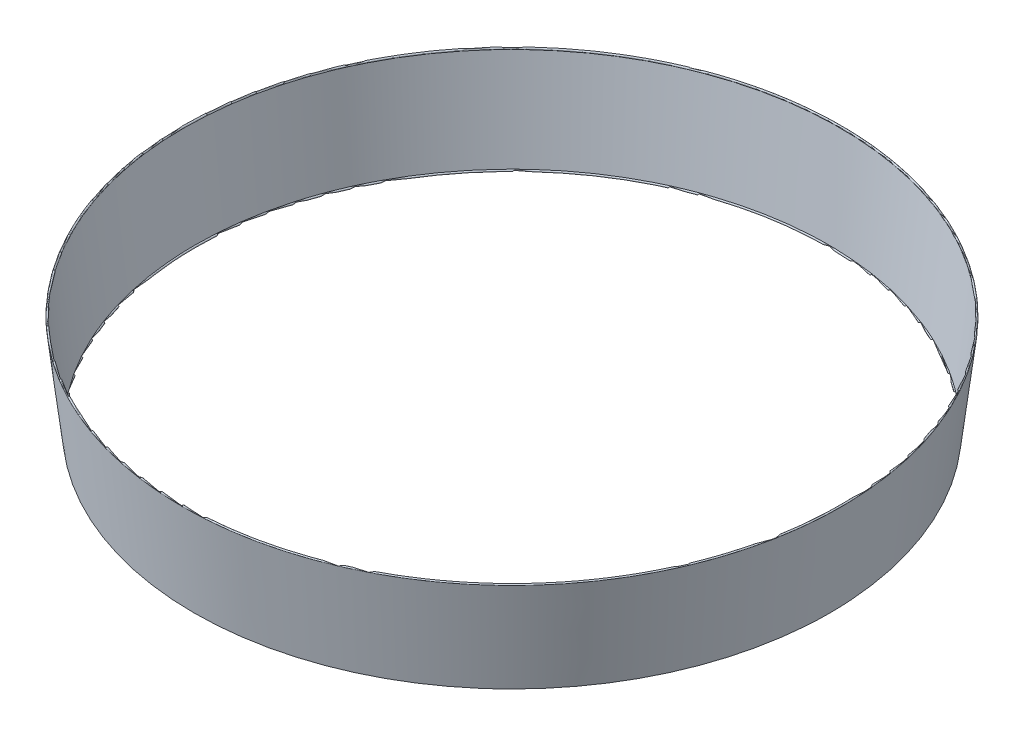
ISO-10303-21;
HEADER;
FILE_DESCRIPTION(('STEP AP214'),'2;1');
FILE_NAME('part.step','',(''),(''),'','','');
FILE_SCHEMA(('AUTOMOTIVE_DESIGN { 1 0 10303 214 1 1 1 1 }'));
ENDSEC;
DATA;
#1=APPLICATION_CONTEXT('core data for automotive mechanical design processes');
#2=APPLICATION_PROTOCOL_DEFINITION('international standard','automotive_design',2000,#1);
#3=PRODUCT_CONTEXT('',#1,'mechanical');
#4=PRODUCT('Part','Part','',(#3));
#5=PRODUCT_RELATED_PRODUCT_CATEGORY('part','',(#4));
#6=PRODUCT_DEFINITION_FORMATION('','',#4);
#7=PRODUCT_DEFINITION_CONTEXT('part definition',#1,'design');
#8=PRODUCT_DEFINITION('design','',#6,#7);
#9=PRODUCT_DEFINITION_SHAPE('','',#8);
#10=(LENGTH_UNIT() NAMED_UNIT(*) SI_UNIT(.MILLI.,.METRE.));
#11=(NAMED_UNIT(*) PLANE_ANGLE_UNIT() SI_UNIT($,.RADIAN.));
#12=(NAMED_UNIT(*) SI_UNIT($,.STERADIAN.) SOLID_ANGLE_UNIT());
#13=UNCERTAINTY_MEASURE_WITH_UNIT(LENGTH_MEASURE(1.E-05),#10,'distance_accuracy_value','');
#14=(GEOMETRIC_REPRESENTATION_CONTEXT(3) GLOBAL_UNCERTAINTY_ASSIGNED_CONTEXT((#13)) GLOBAL_UNIT_ASSIGNED_CONTEXT((#10,
#11,#12)) REPRESENTATION_CONTEXT('',''));
#15=CARTESIAN_POINT('',(0.,0.,0.));
#16=DIRECTION('',(0.,0.,1.));
#17=DIRECTION('',(1.,0.,0.));
#18=AXIS2_PLACEMENT_3D('',#15,#16,#17);
#19=CARTESIAN_POINT('',(0.,0.,0.));
#20=DIRECTION('',(0.,1.,0.));
#21=DIRECTION('',(0.,0.,1.));
#22=AXIS2_PLACEMENT_3D('',#19,#20,#21);
#23=PLANE('',#22);
#24=CARTESIAN_POINT('',(0.,0.,0.));
#25=DIRECTION('',(0.,1.,0.));
#26=DIRECTION('',(0.,0.,1.));
#27=AXIS2_PLACEMENT_3D('',#24,#25,#26);
#28=CIRCLE('',#27,259.597191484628);
#29=CARTESIAN_POINT('',(0.,0.,259.597191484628));
#30=VERTEX_POINT('',#29);
#31=EDGE_CURVE('E83',#30,#30,#28,.T.);
#32=ORIENTED_EDGE('',*,*,#31,.T.);
#33=EDGE_LOOP('',(#32));
#34=FACE_BOUND('',#33,.T.);
#35=CARTESIAN_POINT('',(0.,0.,0.));
#36=DIRECTION('',(0.,1.,0.));
#37=DIRECTION('',(0.,0.,1.));
#38=AXIS2_PLACEMENT_3D('',#35,#36,#37);
#39=CIRCLE('',#38,260.);
#40=CARTESIAN_POINT('',(-260.,0.,2.84494650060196E-13));
#41=VERTEX_POINT('',#40);
#42=EDGE_CURVE('E73',#41,#41,#39,.T.);
#43=ORIENTED_EDGE('',*,*,#42,.F.);
#44=EDGE_LOOP('',(#43));
#45=FACE_BOUND('',#44,.T.);
#46=ADVANCED_FACE('F59',(#34,#45),#23,.F.);
#47=CARTESIAN_POINT('',(0.,80.,0.));
#48=DIRECTION('',(0.,1.,0.));
#49=DIRECTION('',(0.,0.,1.));
#50=AXIS2_PLACEMENT_3D('',#47,#48,#49);
#51=PLANE('',#50);
#52=CARTESIAN_POINT('',(0.,80.,0.));
#53=DIRECTION('',(0.,1.,0.));
#54=DIRECTION('',(0.,0.,1.));
#55=AXIS2_PLACEMENT_3D('',#52,#53,#54);
#56=CIRCLE('',#55,269.485526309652);
#57=CARTESIAN_POINT('',(0.,80.,269.485526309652));
#58=VERTEX_POINT('',#57);
#59=EDGE_CURVE('E12',#58,#58,#56,.T.);
#60=ORIENTED_EDGE('',*,*,#59,.F.);
#61=EDGE_LOOP('',(#60));
#62=FACE_BOUND('',#61,.T.);
#63=CARTESIAN_POINT('',(0.,80.,0.));
#64=DIRECTION('',(0.,1.,0.));
#65=DIRECTION('',(0.,0.,1.));
#66=AXIS2_PLACEMENT_3D('',#63,#64,#65);
#67=CIRCLE('',#66,269.5);
#68=CARTESIAN_POINT('',(-269.5,80.,2.4980018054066E-13));
#69=VERTEX_POINT('',#68);
#70=EDGE_CURVE('E79',#69,#69,#67,.T.);
#71=ORIENTED_EDGE('',*,*,#70,.T.);
#72=EDGE_LOOP('',(#71));
#73=FACE_BOUND('',#72,.T.);
#74=ADVANCED_FACE('F105',(#62,#73),#51,.T.);
#75=CARTESIAN_POINT('',(-269.5,80.,2.4980018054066E-13));
#76=CARTESIAN_POINT('',(-266.333333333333,53.3333333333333,2.61726404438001E-13));
#77=CARTESIAN_POINT('',(-263.166666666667,26.6666666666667,2.7300210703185E-13));
#78=CARTESIAN_POINT('',(-260.,0.,2.84494650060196E-13));
#79=CARTESIAN_POINT('',(-269.5,80.,-3.57369105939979));
#80=CARTESIAN_POINT('',(-266.333333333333,53.3333333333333,-3.53169963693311));
#81=CARTESIAN_POINT('',(-263.166666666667,26.6666666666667,-3.48970821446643));
#82=CARTESIAN_POINT('',(-260.,0.,-3.44771679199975));
#83=CARTESIAN_POINT('',(-269.358024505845,80.,-10.7064632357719));
#84=CARTESIAN_POINT('',(-266.193026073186,53.3333333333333,-10.5806606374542));
#85=CARTESIAN_POINT('',(-263.028027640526,26.6666666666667,-10.4548580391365));
#86=CARTESIAN_POINT('',(-259.863029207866,0.,-10.3290554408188));
#87=CARTESIAN_POINT('',(-268.723822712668,80.,-21.3504740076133));
#88=CARTESIAN_POINT('',(-265.56627624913,53.3333333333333,-21.0996026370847));
#89=CARTESIAN_POINT('',(-262.408729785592,26.6666666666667,-20.8487312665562));
#90=CARTESIAN_POINT('',(-259.251183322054,0.,-20.5978598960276));
#91=CARTESIAN_POINT('',(-267.67307029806,80.,-31.9280196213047));
#92=CARTESIAN_POINT('',(-264.527870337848,53.3333333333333,-31.5528604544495));
#93=CARTESIAN_POINT('',(-261.382670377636,26.6666666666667,-31.1777012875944));
#94=CARTESIAN_POINT('',(-258.237470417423,0.,-30.8025421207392));
#95=CARTESIAN_POINT('',(-258.897379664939,80.,-94.9265963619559));
#96=CARTESIAN_POINT('',(-255.855295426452,53.3333333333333,-93.8111941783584));
#97=CARTESIAN_POINT('',(-252.813211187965,26.6666666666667,-92.6957919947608));
#98=CARTESIAN_POINT('',(-249.771126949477,0.,-91.5803898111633));
#99=CARTESIAN_POINT('',(-230.996976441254,80.,-150.133578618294));
#100=CARTESIAN_POINT('',(-228.282726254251,53.3333333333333,-148.369485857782));
#101=CARTESIAN_POINT('',(-225.568476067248,26.6666666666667,-146.605393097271));
#102=CARTESIAN_POINT('',(-222.854225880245,0.,-144.841300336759));
#103=CARTESIAN_POINT('',(-140.025653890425,80.,-241.104901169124));
#104=CARTESIAN_POINT('',(-138.380330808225,53.3333333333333,-238.271881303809));
#105=CARTESIAN_POINT('',(-136.735007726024,26.6666666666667,-235.438861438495));
#106=CARTESIAN_POINT('',(-135.089684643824,0.,-232.605841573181));
#107=CARTESIAN_POINT('',(-71.4738211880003,80.,-269.5));
#108=CARTESIAN_POINT('',(-70.6339927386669,53.3333333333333,-266.333333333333));
#109=CARTESIAN_POINT('',(-69.7941642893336,26.6666666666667,-263.166666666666));
#110=CARTESIAN_POINT('',(-68.9543358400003,0.,-260.));
#111=CARTESIAN_POINT('',(71.4738211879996,80.,-269.5));
#112=CARTESIAN_POINT('',(70.6339927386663,53.3333333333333,-266.333333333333));
#113=CARTESIAN_POINT('',(69.7941642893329,26.6666666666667,-263.166666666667));
#114=CARTESIAN_POINT('',(68.9543358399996,0.,-260.));
#115=CARTESIAN_POINT('',(140.025653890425,80.,-241.104901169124));
#116=CARTESIAN_POINT('',(138.380330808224,53.3333333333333,-238.27188130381));
#117=CARTESIAN_POINT('',(136.735007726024,26.6666666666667,-235.438861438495));
#118=CARTESIAN_POINT('',(135.089684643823,0.,-232.605841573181));
#119=CARTESIAN_POINT('',(241.104901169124,80.,-140.025653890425));
#120=CARTESIAN_POINT('',(238.27188130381,53.3333333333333,-138.380330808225));
#121=CARTESIAN_POINT('',(235.438861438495,26.6666666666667,-136.735007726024));
#122=CARTESIAN_POINT('',(232.605841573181,0.,-135.089684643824));
#123=CARTESIAN_POINT('',(269.5,80.,-71.4738211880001));
#124=CARTESIAN_POINT('',(266.333333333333,53.3333333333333,-70.6339927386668));
#125=CARTESIAN_POINT('',(263.166666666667,26.6666666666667,-69.7941642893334));
#126=CARTESIAN_POINT('',(260.,0.,-68.9543358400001));
#127=CARTESIAN_POINT('',(269.5,80.,71.4738211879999));
#128=CARTESIAN_POINT('',(266.333333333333,53.3333333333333,70.6339927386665));
#129=CARTESIAN_POINT('',(263.166666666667,26.6666666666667,69.7941642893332));
#130=CARTESIAN_POINT('',(260.,0.,68.9543358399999));
#131=CARTESIAN_POINT('',(241.104901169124,80.,140.025653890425));
#132=CARTESIAN_POINT('',(238.27188130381,53.3333333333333,138.380330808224));
#133=CARTESIAN_POINT('',(235.438861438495,26.6666666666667,136.735007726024));
#134=CARTESIAN_POINT('',(232.605841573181,0.,135.089684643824));
#135=CARTESIAN_POINT('',(140.025653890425,80.,241.104901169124));
#136=CARTESIAN_POINT('',(138.380330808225,53.3333333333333,238.27188130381));
#137=CARTESIAN_POINT('',(136.735007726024,26.6666666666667,235.438861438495));
#138=CARTESIAN_POINT('',(135.089684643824,0.,232.605841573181));
#139=CARTESIAN_POINT('',(71.473821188,80.,269.5));
#140=CARTESIAN_POINT('',(70.6339927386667,53.3333333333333,266.333333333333));
#141=CARTESIAN_POINT('',(69.7941642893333,26.6666666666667,263.166666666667));
#142=CARTESIAN_POINT('',(68.95433584,0.,260.));
#143=CARTESIAN_POINT('',(-71.473821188,80.,269.5));
#144=CARTESIAN_POINT('',(-70.6339927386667,53.3333333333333,266.333333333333));
#145=CARTESIAN_POINT('',(-69.7941642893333,26.6666666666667,263.166666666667));
#146=CARTESIAN_POINT('',(-68.95433584,0.,260.));
#147=CARTESIAN_POINT('',(-140.025653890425,80.,241.104901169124));
#148=CARTESIAN_POINT('',(-138.380330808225,53.3333333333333,238.27188130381));
#149=CARTESIAN_POINT('',(-136.735007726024,26.6666666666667,235.438861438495));
#150=CARTESIAN_POINT('',(-135.089684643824,0.,232.605841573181));
#151=CARTESIAN_POINT('',(-230.996976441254,80.,150.133578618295));
#152=CARTESIAN_POINT('',(-228.282726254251,53.3333333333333,148.369485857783));
#153=CARTESIAN_POINT('',(-225.568476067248,26.6666666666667,146.605393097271));
#154=CARTESIAN_POINT('',(-222.854225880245,0.,144.841300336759));
#155=CARTESIAN_POINT('',(-258.897379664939,80.,94.9265963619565));
#156=CARTESIAN_POINT('',(-255.855295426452,53.3333333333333,93.811194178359));
#157=CARTESIAN_POINT('',(-252.813211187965,26.6666666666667,92.6957919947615));
#158=CARTESIAN_POINT('',(-249.771126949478,0.,91.580389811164));
#159=CARTESIAN_POINT('',(-267.67307029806,80.,31.9280196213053));
#160=CARTESIAN_POINT('',(-264.527870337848,53.3333333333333,31.5528604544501));
#161=CARTESIAN_POINT('',(-261.382670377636,26.6666666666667,31.177701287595));
#162=CARTESIAN_POINT('',(-258.237470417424,0.,30.8025421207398));
#163=CARTESIAN_POINT('',(-268.723822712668,80.,21.3504740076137));
#164=CARTESIAN_POINT('',(-265.56627624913,53.3333333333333,21.0996026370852));
#165=CARTESIAN_POINT('',(-262.408729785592,26.6666666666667,20.8487312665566));
#166=CARTESIAN_POINT('',(-259.251183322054,0.,20.5978598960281));
#167=CARTESIAN_POINT('',(-269.358024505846,80.,10.7064632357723));
#168=CARTESIAN_POINT('',(-266.193026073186,53.3333333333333,10.5806606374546));
#169=CARTESIAN_POINT('',(-263.028027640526,26.6666666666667,10.454858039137));
#170=CARTESIAN_POINT('',(-259.863029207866,0.,10.3290554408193));
#171=CARTESIAN_POINT('',(-269.5,80.,3.57369105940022));
#172=CARTESIAN_POINT('',(-266.333333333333,53.3333333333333,3.53169963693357));
#173=CARTESIAN_POINT('',(-263.166666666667,26.6666666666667,3.48970821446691));
#174=CARTESIAN_POINT('',(-260.,0.,3.44771679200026));
#175=CARTESIAN_POINT('',(-269.5,80.,2.4980018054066E-13));
#176=CARTESIAN_POINT('',(-266.333333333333,53.3333333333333,2.61726404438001E-13));
#177=CARTESIAN_POINT('',(-263.166666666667,26.6666666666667,2.7300210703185E-13));
#178=CARTESIAN_POINT('',(-260.,0.,2.84494650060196E-13));
#179=B_SPLINE_SURFACE_WITH_KNOTS('',3,3,((#75,#76,#77,#78),(#79,#80,#81,#82),(#83,#84,#85,#86),
(#87,#88,#89,#90),(#91,#92,#93,#94),(#95,#96,#97,#98),(#99,#100,#101,#102),(#103,#104,#105,
#106),(#107,#108,#109,#110),(#111,#112,#113,#114),(#115,#116,#117,#118),(#119,#120,#121,#122),
(#123,#124,#125,#126),(#127,#128,#129,#130),(#131,#132,#133,#134),(#135,#136,#137,#138),(#139,
#140,#141,#142),(#143,#144,#145,#146),(#147,#148,#149,#150),(#151,#152,#153,#154),(#155,#156,
#157,#158),(#159,#160,#161,#162),(#163,#164,#165,#166),(#167,#168,#169,#170),(#171,#172,#173,
#174),(#175,#176,#177,#178)),.UNSPECIFIED.,.T.,.F.,.F.,(4,1,1,1,1,2,2,2,2,2,2,2,1,1,1,1,4),(4,
4),(0.,0.00625000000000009,0.0125,0.01875,0.0249999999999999,0.125,0.25,0.375,0.5,0.625,0.75,
0.875,0.975,0.98125,0.9875,0.99375,1.),(0.,1.),.UNSPECIFIED.);
#180=CARTESIAN_POINT('',(-269.5,80.,2.4980018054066E-13));
#181=CARTESIAN_POINT('',(-269.401041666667,79.1666666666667,2.50172875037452E-13));
#182=CARTESIAN_POINT('',(-269.302083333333,78.3333333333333,2.50544934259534E-13));
#183=CARTESIAN_POINT('',(-269.104166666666,76.6666666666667,2.51287835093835E-13));
#184=CARTESIAN_POINT('',(-269.005208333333,75.8333333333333,2.51658676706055E-13));
#185=CARTESIAN_POINT('',(-268.807291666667,74.1666666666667,2.52399195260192E-13));
#186=CARTESIAN_POINT('',(-268.708333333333,73.3333333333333,2.52768872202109E-13));
#187=CARTESIAN_POINT('',(-268.510416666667,71.6666666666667,2.535071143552E-13));
#188=CARTESIAN_POINT('',(-268.411458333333,70.8333333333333,2.53875679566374E-13));
#189=CARTESIAN_POINT('',(-268.213541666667,69.1666666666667,2.54611751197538E-13));
#190=CARTESIAN_POINT('',(-268.114583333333,68.3333333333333,2.54979257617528E-13));
#191=CARTESIAN_POINT('',(-267.916666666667,66.6666666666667,2.55713264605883E-13));
#192=CARTESIAN_POINT('',(-267.817708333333,65.8333333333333,2.56079765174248E-13));
#193=CARTESIAN_POINT('',(-267.619791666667,64.1666666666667,2.56811813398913E-13));
#194=CARTESIAN_POINT('',(-267.520833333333,63.3333333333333,2.57177361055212E-13));
#195=CARTESIAN_POINT('',(-267.322916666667,61.6666666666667,2.57907556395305E-13));
#196=CARTESIAN_POINT('',(-267.223958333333,60.8333333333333,2.58272204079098E-13));
#197=CARTESIAN_POINT('',(-267.026041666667,59.1666666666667,2.59000652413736E-13));
#198=CARTESIAN_POINT('',(-266.927083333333,58.3333333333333,2.59364453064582E-13));
#199=CARTESIAN_POINT('',(-266.729166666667,56.6666666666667,2.60091260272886E-13));
#200=CARTESIAN_POINT('',(-266.630208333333,55.8333333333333,2.60454266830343E-13));
#201=CARTESIAN_POINT('',(-266.432291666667,54.1666666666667,2.6117953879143E-13));
#202=CARTESIAN_POINT('',(-266.333333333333,53.3333333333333,2.61541804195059E-13));
#203=CARTESIAN_POINT('',(-266.135416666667,51.6666666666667,2.62265646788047E-13));
#204=CARTESIAN_POINT('',(-266.036458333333,50.8333333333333,2.62627223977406E-13));
#205=CARTESIAN_POINT('',(-265.838541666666,49.1666666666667,2.63349743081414E-13));
#206=CARTESIAN_POINT('',(-265.739583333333,48.3333333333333,2.63710684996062E-13));
#207=CARTESIAN_POINT('',(-265.541666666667,46.6666666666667,2.64431986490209E-13));
#208=CARTESIAN_POINT('',(-265.442708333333,45.8333333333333,2.64792346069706E-13));
#209=CARTESIAN_POINT('',(-265.244791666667,44.1666666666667,2.65512535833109E-13));
#210=CARTESIAN_POINT('',(-265.145833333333,43.3333333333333,2.65872366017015E-13));
#211=CARTESIAN_POINT('',(-264.947916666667,41.6666666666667,2.66591549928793E-13));
#212=CARTESIAN_POINT('',(-264.848958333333,40.8333333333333,2.66950903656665E-13));
#213=CARTESIAN_POINT('',(-264.651041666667,39.1666666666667,2.67669187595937E-13));
#214=CARTESIAN_POINT('',(-264.552083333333,38.3333333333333,2.68028117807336E-13));
#215=CARTESIAN_POINT('',(-264.354166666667,36.6666666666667,2.6874560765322E-13));
#216=CARTESIAN_POINT('',(-264.255208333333,35.8333333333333,2.69104167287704E-13));
#217=CARTESIAN_POINT('',(-264.057291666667,34.1666666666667,2.69820968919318E-13));
#218=CARTESIAN_POINT('',(-263.958333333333,33.3333333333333,2.70179210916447E-13));
#219=CARTESIAN_POINT('',(-263.760416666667,31.6666666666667,2.7089543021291E-13));
#220=CARTESIAN_POINT('',(-263.661458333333,30.8333333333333,2.71253407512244E-13));
#221=CARTESIAN_POINT('',(-263.463541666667,29.1666666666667,2.71969150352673E-13));
#222=CARTESIAN_POINT('',(-263.364583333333,28.3333333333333,2.7232691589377E-13));
#223=CARTESIAN_POINT('',(-263.166666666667,26.6666666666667,2.73042288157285E-13));
#224=CARTESIAN_POINT('',(-263.067708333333,25.8333333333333,2.73399894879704E-13));
#225=CARTESIAN_POINT('',(-262.869791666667,24.1666666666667,2.74115002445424E-13));
#226=CARTESIAN_POINT('',(-262.770833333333,23.3333333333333,2.74472503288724E-13));
#227=CARTESIAN_POINT('',(-262.572916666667,21.6666666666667,2.75187452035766E-13));
#228=CARTESIAN_POINT('',(-262.473958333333,20.8333333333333,2.75544899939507E-13));
#229=CARTESIAN_POINT('',(-262.276041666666,19.1666666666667,2.7625979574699E-13));
#230=CARTESIAN_POINT('',(-262.177083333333,18.3333333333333,2.76617243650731E-13));
#231=CARTESIAN_POINT('',(-261.979166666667,16.6666666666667,2.77332192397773E-13));
#232=CARTESIAN_POINT('',(-261.880208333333,15.8333333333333,2.77689693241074E-13));
#233=CARTESIAN_POINT('',(-261.682291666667,14.1666666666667,2.78404800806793E-13));
#234=CARTESIAN_POINT('',(-261.583333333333,13.3333333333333,2.78762407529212E-13));
#235=CARTESIAN_POINT('',(-261.385416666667,11.6666666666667,2.79477779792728E-13));
#236=CARTESIAN_POINT('',(-261.286458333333,10.8333333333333,2.79835545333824E-13));
#237=CARTESIAN_POINT('',(-261.088541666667,9.16666666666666,2.80551288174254E-13));
#238=CARTESIAN_POINT('',(-260.989583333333,8.33333333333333,2.80909265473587E-13));
#239=CARTESIAN_POINT('',(-260.791666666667,6.66666666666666,2.8162548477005E-13));
#240=CARTESIAN_POINT('',(-260.692708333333,5.83333333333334,2.81983726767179E-13));
#241=CARTESIAN_POINT('',(-260.494791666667,4.16666666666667,2.82700528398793E-13));
#242=CARTESIAN_POINT('',(-260.395833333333,3.33333333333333,2.83059088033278E-13));
#243=CARTESIAN_POINT('',(-260.197916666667,1.66666666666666,2.83776577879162E-13));
#244=CARTESIAN_POINT('',(-260.098958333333,0.833333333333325,2.84135508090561E-13));
#245=CARTESIAN_POINT('',(-260.,0.,2.84494650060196E-13));
#246=B_SPLINE_CURVE_WITH_KNOTS('',3,(#180,#181,#182,#183,#184,#185,#186,#187,#188,#189,#190,
#191,#192,#193,#194,#195,#196,#197,#198,#199,#200,#201,#202,#203,#204,#205,#206,#207,#208,#209,
#210,#211,#212,#213,#214,#215,#216,#217,#218,#219,#220,#221,#222,#223,#224,#225,#226,#227,#228,
#229,#230,#231,#232,#233,#234,#235,#236,#237,#238,#239,#240,#241,#242,#243,#244,#245),
.UNSPECIFIED.,.F.,.F.,(4,2,2,2,2,2,2,2,2,2,2,2,2,2,2,2,2,2,2,2,2,2,2,2,2,2,2,2,2,2,2,2,4),(0.,
2.51756524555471,5.03513049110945,7.55269573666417,10.0702609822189,12.5878262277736,
15.1053914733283,17.6229567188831,20.1405219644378,22.6580872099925,25.1756524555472,
27.6932177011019,30.2107829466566,32.7283481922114,35.2459134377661,37.7634786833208,
40.2810439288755,42.7986091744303,45.316174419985,47.8337396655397,50.3513049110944,
52.8688701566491,55.3864354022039,57.9040006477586,60.4215658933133,62.939131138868,
65.4566963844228,67.9742616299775,70.4918268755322,73.0093921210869,75.5269573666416,
78.0445226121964,80.5620878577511),.UNSPECIFIED.);
#247=EDGE_CURVE('BSEAM93',#69,#41,#246,.T.);
#248=ORIENTED_EDGE('',*,*,#70,.F.);
#249=ORIENTED_EDGE('',*,*,#42,.T.);
#250=ORIENTED_EDGE('',*,*,#247,.T.);
#251=ORIENTED_EDGE('',*,*,#247,.F.);
#252=EDGE_LOOP('',(#248,#250,#249,#251));
#253=FACE_BOUND('',#252,.T.);
#254=ADVANCED_FACE('F93',(#253),#179,.T.);
#255=CARTESIAN_POINT('',(-269.5,80.,2.4980018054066E-13));
#256=CARTESIAN_POINT('',(-266.333333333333,53.3333333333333,2.61726404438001E-13));
#257=CARTESIAN_POINT('',(-263.166666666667,26.6666666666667,2.7300210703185E-13));
#258=CARTESIAN_POINT('',(-260.,0.,2.84494650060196E-13));
#259=CARTESIAN_POINT('',(-269.5,80.,-3.57369105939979));
#260=CARTESIAN_POINT('',(-266.333333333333,53.3333333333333,-3.53169963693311));
#261=CARTESIAN_POINT('',(-263.166666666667,26.6666666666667,-3.48970821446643));
#262=CARTESIAN_POINT('',(-260.,0.,-3.44771679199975));
#263=CARTESIAN_POINT('',(-269.358024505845,80.,-10.7064632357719));
#264=CARTESIAN_POINT('',(-266.193026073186,53.3333333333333,-10.5806606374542));
#265=CARTESIAN_POINT('',(-263.028027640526,26.6666666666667,-10.4548580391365));
#266=CARTESIAN_POINT('',(-259.863029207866,0.,-10.3290554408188));
#267=CARTESIAN_POINT('',(-268.723822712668,80.,-21.3504740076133));
#268=CARTESIAN_POINT('',(-265.56627624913,53.3333333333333,-21.0996026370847));
#269=CARTESIAN_POINT('',(-262.408729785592,26.6666666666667,-20.8487312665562));
#270=CARTESIAN_POINT('',(-259.251183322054,0.,-20.5978598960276));
#271=CARTESIAN_POINT('',(-267.67307029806,80.,-31.9280196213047));
#272=CARTESIAN_POINT('',(-264.527870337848,53.3333333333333,-31.5528604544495));
#273=CARTESIAN_POINT('',(-261.382670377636,26.6666666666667,-31.1777012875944));
#274=CARTESIAN_POINT('',(-258.237470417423,0.,-30.8025421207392));
#275=CARTESIAN_POINT('',(-258.897379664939,80.,-94.9265963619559));
#276=CARTESIAN_POINT('',(-255.855295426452,53.3333333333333,-93.8111941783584));
#277=CARTESIAN_POINT('',(-252.813211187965,26.6666666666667,-92.6957919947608));
#278=CARTESIAN_POINT('',(-249.771126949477,0.,-91.5803898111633));
#279=CARTESIAN_POINT('',(-230.996976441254,80.,-150.133578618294));
#280=CARTESIAN_POINT('',(-228.282726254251,53.3333333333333,-148.369485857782));
#281=CARTESIAN_POINT('',(-225.568476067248,26.6666666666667,-146.605393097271));
#282=CARTESIAN_POINT('',(-222.854225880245,0.,-144.841300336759));
#283=CARTESIAN_POINT('',(-140.025653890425,80.,-241.104901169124));
#284=CARTESIAN_POINT('',(-138.380330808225,53.3333333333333,-238.271881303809));
#285=CARTESIAN_POINT('',(-136.735007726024,26.6666666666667,-235.438861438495));
#286=CARTESIAN_POINT('',(-135.089684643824,0.,-232.605841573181));
#287=CARTESIAN_POINT('',(-71.4738211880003,80.,-269.5));
#288=CARTESIAN_POINT('',(-70.6339927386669,53.3333333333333,-266.333333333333));
#289=CARTESIAN_POINT('',(-69.7941642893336,26.6666666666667,-263.166666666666));
#290=CARTESIAN_POINT('',(-68.9543358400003,0.,-260.));
#291=CARTESIAN_POINT('',(71.4738211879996,80.,-269.5));
#292=CARTESIAN_POINT('',(70.6339927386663,53.3333333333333,-266.333333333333));
#293=CARTESIAN_POINT('',(69.7941642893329,26.6666666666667,-263.166666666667));
#294=CARTESIAN_POINT('',(68.9543358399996,0.,-260.));
#295=CARTESIAN_POINT('',(140.025653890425,80.,-241.104901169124));
#296=CARTESIAN_POINT('',(138.380330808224,53.3333333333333,-238.27188130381));
#297=CARTESIAN_POINT('',(136.735007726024,26.6666666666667,-235.438861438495));
#298=CARTESIAN_POINT('',(135.089684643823,0.,-232.605841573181));
#299=CARTESIAN_POINT('',(241.104901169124,80.,-140.025653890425));
#300=CARTESIAN_POINT('',(238.27188130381,53.3333333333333,-138.380330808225));
#301=CARTESIAN_POINT('',(235.438861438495,26.6666666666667,-136.735007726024));
#302=CARTESIAN_POINT('',(232.605841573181,0.,-135.089684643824));
#303=CARTESIAN_POINT('',(269.5,80.,-71.4738211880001));
#304=CARTESIAN_POINT('',(266.333333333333,53.3333333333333,-70.6339927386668));
#305=CARTESIAN_POINT('',(263.166666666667,26.6666666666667,-69.7941642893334));
#306=CARTESIAN_POINT('',(260.,0.,-68.9543358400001));
#307=CARTESIAN_POINT('',(269.5,80.,71.4738211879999));
#308=CARTESIAN_POINT('',(266.333333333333,53.3333333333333,70.6339927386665));
#309=CARTESIAN_POINT('',(263.166666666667,26.6666666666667,69.7941642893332));
#310=CARTESIAN_POINT('',(260.,0.,68.9543358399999));
#311=CARTESIAN_POINT('',(241.104901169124,80.,140.025653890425));
#312=CARTESIAN_POINT('',(238.27188130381,53.3333333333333,138.380330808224));
#313=CARTESIAN_POINT('',(235.438861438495,26.6666666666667,136.735007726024));
#314=CARTESIAN_POINT('',(232.605841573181,0.,135.089684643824));
#315=CARTESIAN_POINT('',(140.025653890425,80.,241.104901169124));
#316=CARTESIAN_POINT('',(138.380330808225,53.3333333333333,238.27188130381));
#317=CARTESIAN_POINT('',(136.735007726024,26.6666666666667,235.438861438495));
#318=CARTESIAN_POINT('',(135.089684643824,0.,232.605841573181));
#319=CARTESIAN_POINT('',(71.473821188,80.,269.5));
#320=CARTESIAN_POINT('',(70.6339927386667,53.3333333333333,266.333333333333));
#321=CARTESIAN_POINT('',(69.7941642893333,26.6666666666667,263.166666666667));
#322=CARTESIAN_POINT('',(68.95433584,0.,260.));
#323=CARTESIAN_POINT('',(-71.473821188,80.,269.5));
#324=CARTESIAN_POINT('',(-70.6339927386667,53.3333333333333,266.333333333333));
#325=CARTESIAN_POINT('',(-69.7941642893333,26.6666666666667,263.166666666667));
#326=CARTESIAN_POINT('',(-68.95433584,0.,260.));
#327=CARTESIAN_POINT('',(-140.025653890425,80.,241.104901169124));
#328=CARTESIAN_POINT('',(-138.380330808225,53.3333333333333,238.27188130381));
#329=CARTESIAN_POINT('',(-136.735007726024,26.6666666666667,235.438861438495));
#330=CARTESIAN_POINT('',(-135.089684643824,0.,232.605841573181));
#331=CARTESIAN_POINT('',(-230.996976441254,80.,150.133578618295));
#332=CARTESIAN_POINT('',(-228.282726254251,53.3333333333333,148.369485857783));
#333=CARTESIAN_POINT('',(-225.568476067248,26.6666666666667,146.605393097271));
#334=CARTESIAN_POINT('',(-222.854225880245,0.,144.841300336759));
#335=CARTESIAN_POINT('',(-258.897379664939,80.,94.9265963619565));
#336=CARTESIAN_POINT('',(-255.855295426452,53.3333333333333,93.811194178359));
#337=CARTESIAN_POINT('',(-252.813211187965,26.6666666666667,92.6957919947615));
#338=CARTESIAN_POINT('',(-249.771126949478,0.,91.580389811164));
#339=CARTESIAN_POINT('',(-267.67307029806,80.,31.9280196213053));
#340=CARTESIAN_POINT('',(-264.527870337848,53.3333333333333,31.5528604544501));
#341=CARTESIAN_POINT('',(-261.382670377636,26.6666666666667,31.177701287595));
#342=CARTESIAN_POINT('',(-258.237470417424,0.,30.8025421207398));
#343=CARTESIAN_POINT('',(-268.723822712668,80.,21.3504740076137));
#344=CARTESIAN_POINT('',(-265.56627624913,53.3333333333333,21.0996026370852));
#345=CARTESIAN_POINT('',(-262.408729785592,26.6666666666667,20.8487312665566));
#346=CARTESIAN_POINT('',(-259.251183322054,0.,20.5978598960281));
#347=CARTESIAN_POINT('',(-269.358024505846,80.,10.7064632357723));
#348=CARTESIAN_POINT('',(-266.193026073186,53.3333333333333,10.5806606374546));
#349=CARTESIAN_POINT('',(-263.028027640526,26.6666666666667,10.454858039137));
#350=CARTESIAN_POINT('',(-259.863029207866,0.,10.3290554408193));
#351=CARTESIAN_POINT('',(-269.5,80.,3.57369105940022));
#352=CARTESIAN_POINT('',(-266.333333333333,53.3333333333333,3.53169963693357));
#353=CARTESIAN_POINT('',(-263.166666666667,26.6666666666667,3.48970821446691));
#354=CARTESIAN_POINT('',(-260.,0.,3.44771679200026));
#355=CARTESIAN_POINT('',(-269.5,80.,2.4980018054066E-13));
#356=CARTESIAN_POINT('',(-266.333333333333,53.3333333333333,2.61726404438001E-13));
#357=CARTESIAN_POINT('',(-263.166666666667,26.6666666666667,2.7300210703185E-13));
#358=CARTESIAN_POINT('',(-260.,0.,2.84494650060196E-13));
#359=B_SPLINE_SURFACE_WITH_KNOTS('',3,3,((#255,#256,#257,#258),(#259,#260,#261,#262),(#263,#264,
#265,#266),(#267,#268,#269,#270),(#271,#272,#273,#274),(#275,#276,#277,#278),(#279,#280,#281,
#282),(#283,#284,#285,#286),(#287,#288,#289,#290),(#291,#292,#293,#294),(#295,#296,#297,#298),
(#299,#300,#301,#302),(#303,#304,#305,#306),(#307,#308,#309,#310),(#311,#312,#313,#314),(#315,
#316,#317,#318),(#319,#320,#321,#322),(#323,#324,#325,#326),(#327,#328,#329,#330),(#331,#332,
#333,#334),(#335,#336,#337,#338),(#339,#340,#341,#342),(#343,#344,#345,#346),(#347,#348,#349,
#350),(#351,#352,#353,#354),(#355,#356,#357,#358)),.UNSPECIFIED.,.T.,.F.,.F.,(4,1,1,1,1,2,2,2,2,
2,2,2,1,1,1,1,4),(4,4),(0.,0.00625000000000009,0.0125,0.01875,0.0249999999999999,0.125,0.25,
0.375,0.5,0.625,0.75,0.875,0.975,0.98125,0.9875,0.99375,1.),(0.,1.),.UNSPECIFIED.);
#360=OFFSET_SURFACE('',#359,-1.,.F.);
#361=CARTESIAN_POINT('',(-259.123694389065,1.10080410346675,2.84071153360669E-13));
#362=CARTESIAN_POINT('',(-259.123694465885,1.10080410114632,-0.500004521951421));
#363=CARTESIAN_POINT('',(-259.122249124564,1.10080364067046,-1.00000542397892));
#364=CARTESIAN_POINT('',(-259.113575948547,1.10080105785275,-2.50007212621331));
#365=CARTESIAN_POINT('',(-259.10201048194,1.10079773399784,-3.5001189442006));
#366=CARTESIAN_POINT('',(-259.067311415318,1.10078877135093,-5.49999567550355));
#367=CARTESIAN_POINT('',(-259.044177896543,1.10078313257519,-6.49982559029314));
#368=CARTESIAN_POINT('',(-258.957365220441,1.10076391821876,-9.50083597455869));
#369=CARTESIAN_POINT('',(-258.876285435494,1.10074805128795,-11.5015439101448));
#370=CARTESIAN_POINT('',(-258.667779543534,1.1007151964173,-15.5005388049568));
#371=CARTESIAN_POINT('',(-258.540352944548,1.10069820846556,-17.4988257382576));
#372=CARTESIAN_POINT('',(-258.239114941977,1.10066657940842,-21.4931068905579));
#373=CARTESIAN_POINT('',(-258.065276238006,1.10065193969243,-23.4890990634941));
#374=CARTESIAN_POINT('',(-257.671320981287,1.10062715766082,-27.4767182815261));
#375=CARTESIAN_POINT('',(-257.451198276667,1.1006170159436,-29.4683447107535));
#376=CARTESIAN_POINT('',(-256.619490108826,1.10059244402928,-36.2694554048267));
#377=CARTESIAN_POINT('',(-255.89576889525,1.10059236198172,-41.0657677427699));
#378=CARTESIAN_POINT('',(-254.179808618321,1.10062381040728,-50.6126038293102));
#379=CARTESIAN_POINT('',(-253.187415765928,1.10065535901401,-55.3630997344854));
#380=CARTESIAN_POINT('',(-250.937294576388,1.10073066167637,-64.8016856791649));
#381=CARTESIAN_POINT('',(-249.679525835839,1.10077441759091,-69.489766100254));
#382=CARTESIAN_POINT('',(-246.900207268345,1.10085257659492,-78.7965949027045));
#383=CARTESIAN_POINT('',(-245.378169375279,1.10088696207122,-83.4151975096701));
#384=CARTESIAN_POINT('',(-242.077064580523,1.10093084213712,-92.5588309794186));
#385=CARTESIAN_POINT('',(-240.298034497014,1.10094034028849,-97.0838751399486));
#386=CARTESIAN_POINT('',(-236.48841075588,1.10093034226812,-106.026744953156));
#387=CARTESIAN_POINT('',(-234.457827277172,1.10091084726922,-110.444574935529));
#388=CARTESIAN_POINT('',(-230.691159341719,1.10085890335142,-118.067064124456));
#389=CARTESIAN_POINT('',(-229.008740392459,1.1008309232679,-121.298377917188));
#390=CARTESIAN_POINT('',(-225.509045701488,1.10077098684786,-127.687494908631));
#391=CARTESIAN_POINT('',(-223.691761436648,1.10073903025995,-130.845293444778));
#392=CARTESIAN_POINT('',(-219.925653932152,1.10068019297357,-137.081463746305));
#393=CARTESIAN_POINT('',(-217.976829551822,1.10065331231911,-140.159834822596));
#394=CARTESIAN_POINT('',(-213.951123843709,1.10061338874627,-146.231589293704));
#395=CARTESIAN_POINT('',(-211.874245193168,1.10060034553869,-149.224974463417));
#396=CARTESIAN_POINT('',(-207.597116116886,1.10059384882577,-155.120041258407));
#397=CARTESIAN_POINT('',(-205.396926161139,1.10060038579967,-158.021766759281));
#398=CARTESIAN_POINT('',(-200.876119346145,1.10063190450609,-163.729943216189));
#399=CARTESIAN_POINT('',(-198.555500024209,1.10065688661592,-166.536392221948));
#400=CARTESIAN_POINT('',(-193.798007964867,1.1007156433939,-172.04901973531));
#401=CARTESIAN_POINT('',(-191.361133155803,1.10074941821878,-174.755196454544));
#402=CARTESIAN_POINT('',(-186.375674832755,1.1007961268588,-180.062399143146));
#403=CARTESIAN_POINT('',(-183.827098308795,1.10080906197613,-182.663431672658));
#404=CARTESIAN_POINT('',(-179.489497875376,1.10079332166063,-186.907807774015));
#405=CARTESIAN_POINT('',(-177.730176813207,1.10077706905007,-188.581615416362));
#406=CARTESIAN_POINT('',(-174.165191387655,1.10074003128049,-191.879148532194));
#407=CARTESIAN_POINT('',(-172.359526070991,1.10071924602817,-193.502872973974));
#408=CARTESIAN_POINT('',(-166.875202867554,1.10066018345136,-198.296839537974));
#409=CARTESIAN_POINT('',(-163.128840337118,1.10062519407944,-201.390244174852));
#410=CARTESIAN_POINT('',(-155.468354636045,1.10059150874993,-207.361323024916));
#411=CARTESIAN_POINT('',(-151.554232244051,1.10059281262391,-210.238998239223));
#412=CARTESIAN_POINT('',(-143.569964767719,1.10062634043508,-215.770056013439));
#413=CARTESIAN_POINT('',(-139.499805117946,1.10065856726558,-218.423417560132));
#414=CARTESIAN_POINT('',(-131.21677169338,1.10073463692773,-223.497167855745));
#415=CARTESIAN_POINT('',(-127.003897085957,1.10077847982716,-225.917555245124));
#416=CARTESIAN_POINT('',(-118.448798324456,1.1008560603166,-230.517783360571));
#417=CARTESIAN_POINT('',(-114.106574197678,1.10088979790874,-232.697624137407));
#418=CARTESIAN_POINT('',(-105.306981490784,1.10093210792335,-236.809711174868));
#419=CARTESIAN_POINT('',(-100.849624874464,1.10094068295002,-238.741983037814));
#420=CARTESIAN_POINT('',(-91.8334133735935,1.10092899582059,-242.35311091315));
#421=CARTESIAN_POINT('',(-87.2745584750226,1.10090873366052,-244.031966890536));
#422=CARTESIAN_POINT('',(-78.0697523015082,1.10084816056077,-247.130920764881));
#423=CARTESIAN_POINT('',(-73.4238013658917,1.10080784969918,-248.551019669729));
#424=CARTESIAN_POINT('',(-64.0595012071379,1.10072575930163,-251.127891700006));
#425=CARTESIAN_POINT('',(-59.3411529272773,1.10068397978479,-252.284668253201));
#426=CARTESIAN_POINT('',(-49.8468787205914,1.10062120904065,-254.331177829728));
#427=CARTESIAN_POINT('',(-45.07095262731,1.10060021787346,-255.220910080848));
#428=CARTESIAN_POINT('',(-35.476641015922,1.10059328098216,-256.730454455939));
#429=CARTESIAN_POINT('',(-30.658255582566,1.10060733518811,-257.350267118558));
#430=CARTESIAN_POINT('',(-20.9938538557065,1.10066754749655,-258.318065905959));
#431=CARTESIAN_POINT('',(-16.147835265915,1.10071370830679,-258.666029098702));
#432=CARTESIAN_POINT('',(-6.44388764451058,1.1007850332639,-259.089159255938));
#433=CARTESIAN_POINT('',(-1.58595855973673,1.10081019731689,-259.16432500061));
#434=CARTESIAN_POINT('',(8.12644728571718,1.10078609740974,-259.041839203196));
#435=CARTESIAN_POINT('',(12.9809240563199,1.10073683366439,-258.84418844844));
#436=CARTESIAN_POINT('',(22.6711275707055,1.10065486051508,-258.176320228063));
#437=CARTESIAN_POINT('',(27.506854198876,1.10062215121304,-257.706101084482));
#438=CARTESIAN_POINT('',(37.1442175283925,1.1005915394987,-256.494509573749));
#439=CARTESIAN_POINT('',(41.9458542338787,1.10059363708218,-255.753137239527));
#440=CARTESIAN_POINT('',(51.4998299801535,1.10062875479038,-254.001604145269));
#441=CARTESIAN_POINT('',(56.252169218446,1.10066177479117,-252.991444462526));
#442=CARTESIAN_POINT('',(65.6925047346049,1.1007386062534,-250.705622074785));
#443=CARTESIAN_POINT('',(70.3805017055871,1.10078241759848,-249.429962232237));
#444=CARTESIAN_POINT('',(79.6774360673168,1.1008593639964,-246.617241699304));
#445=CARTESIAN_POINT('',(84.2863730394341,1.10089249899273,-245.080179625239));
#446=CARTESIAN_POINT('',(93.410624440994,1.10093329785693,-241.749571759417));
#447=CARTESIAN_POINT('',(97.9259388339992,1.1009409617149,-239.956025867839));
#448=CARTESIAN_POINT('',(106.848696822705,1.10092753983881,-236.118124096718));
#449=CARTESIAN_POINT('',(111.256140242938,1.10090645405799,-234.073767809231));
#450=CARTESIAN_POINT('',(119.949211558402,1.10084468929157,-229.740670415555));
#451=CARTESIAN_POINT('',(124.234839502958,1.1008040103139,-227.451929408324));
#452=CARTESIAN_POINT('',(132.670679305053,1.1007218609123,-222.637239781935));
#453=CARTESIAN_POINT('',(136.820891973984,1.10068039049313,-220.111292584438));
#454=CARTESIAN_POINT('',(144.973621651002,1.10061890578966,-214.829529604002));
#455=CARTESIAN_POINT('',(148.976107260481,1.10059889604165,-212.073665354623));
#456=CARTESIAN_POINT('',(156.819779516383,1.10059406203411,-206.341191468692));
#457=CARTESIAN_POINT('',(160.660965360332,1.10060923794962,-203.364580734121));
#458=CARTESIAN_POINT('',(168.16987110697,1.10067136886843,-197.200054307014));
#459=CARTESIAN_POINT('',(171.837590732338,1.10071832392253,-194.012138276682));
#460=CARTESIAN_POINT('',(178.988087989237,1.10078771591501,-187.435280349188));
#461=CARTESIAN_POINT('',(182.470866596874,1.1008101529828,-184.046339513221));
#462=CARTESIAN_POINT('',(189.240652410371,1.10078267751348,-177.078248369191));
#463=CARTESIAN_POINT('',(192.52765944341,1.1007327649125,-173.49909789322));
#464=CARTESIAN_POINT('',(198.895225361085,1.10065119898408,-166.161664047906));
#465=CARTESIAN_POINT('',(201.975785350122,1.10061954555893,-162.403381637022));
#466=CARTESIAN_POINT('',(207.920015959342,1.10059118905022,-154.720369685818));
#467=CARTESIAN_POINT('',(210.783734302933,1.10059447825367,-150.795677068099));
#468=CARTESIAN_POINT('',(216.285999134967,1.10063150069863,-142.7914818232));
#469=CARTESIAN_POINT('',(218.924544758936,1.100665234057,-138.711978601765));
#470=CARTESIAN_POINT('',(223.968171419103,1.10074275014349,-130.411130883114));
#471=CARTESIAN_POINT('',(226.373252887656,1.100786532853,-126.189786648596));
#472=CARTESIAN_POINT('',(230.942431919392,1.10086279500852,-117.61863312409));
#473=CARTESIAN_POINT('',(233.106529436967,1.10089527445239,-113.268823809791));
#474=CARTESIAN_POINT('',(237.186962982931,1.10093445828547,-104.454495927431));
#475=CARTESIAN_POINT('',(239.103298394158,1.10094116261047,-99.9899770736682));
#476=CARTESIAN_POINT('',(242.682159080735,1.10092592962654,-90.9603480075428));
#477=CARTESIAN_POINT('',(244.344684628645,1.10090399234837,-86.3952379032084));
#478=CARTESIAN_POINT('',(247.410774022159,1.10084101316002,-77.1784238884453));
#479=CARTESIAN_POINT('',(248.81431531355,1.10079996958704,-72.5267124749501));
#480=CARTESIAN_POINT('',(251.357748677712,1.10071780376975,-63.1517552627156));
#481=CARTESIAN_POINT('',(252.497640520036,1.10067668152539,-58.4285094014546));
#482=CARTESIAN_POINT('',(254.510075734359,1.10061659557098,-48.9254279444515));
#483=CARTESIAN_POINT('',(255.382620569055,1.1005976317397,-44.1455926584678));
#484=CARTESIAN_POINT('',(256.857554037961,1.10059498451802,-34.544443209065));
#485=CARTESIAN_POINT('',(257.459943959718,1.10061130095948,-29.7231292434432));
#486=CARTESIAN_POINT('',(258.392684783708,1.10067530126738,-20.054233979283));
#487=CARTESIAN_POINT('',(258.723034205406,1.10072298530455,-15.2066525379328));
#488=CARTESIAN_POINT('',(259.110886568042,1.10079028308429,-5.50058848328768));
#489=CARTESIAN_POINT('',(259.16838927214,1.10080989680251,-0.642105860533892));
#490=CARTESIAN_POINT('',(259.010543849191,1.10077910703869,9.0700871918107));
#491=CARTESIAN_POINT('',(258.795214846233,1.10072870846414,13.9237979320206));
#492=CARTESIAN_POINT('',(258.092051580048,1.10064771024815,23.6114354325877));
#493=CARTESIAN_POINT('',(257.604217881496,1.10061711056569,28.4453622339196));
#494=CARTESIAN_POINT('',(256.357531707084,1.10059095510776,38.0781135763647));
#495=CARTESIAN_POINT('',(255.598680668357,1.10059539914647,42.876938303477));
#496=CARTESIAN_POINT('',(253.812377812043,1.10063424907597,52.4243473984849));
#497=CARTESIAN_POINT('',(252.78492516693,1.10066865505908,57.1729316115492));
#498=CARTESIAN_POINT('',(250.464743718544,1.10074679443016,66.6048741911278));
#499=CARTESIAN_POINT('',(249.172013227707,1.10079052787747,71.2882321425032));
#500=CARTESIAN_POINT('',(246.325449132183,1.1008660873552,80.5749132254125));
#501=CARTESIAN_POINT('',(244.771615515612,1.10089791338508,85.1782363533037));
#502=CARTESIAN_POINT('',(241.407950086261,1.1009355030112,94.2899426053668));
#503=CARTESIAN_POINT('',(239.598139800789,1.10094126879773,98.79833367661));
#504=CARTESIAN_POINT('',(235.72814644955,1.10092428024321,107.706343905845));
#505=CARTESIAN_POINT('',(233.667963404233,1.10090152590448,112.105963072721));
#506=CARTESIAN_POINT('',(229.303701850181,1.10083740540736,120.782501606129));
#507=CARTESIAN_POINT('',(226.999624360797,1.10079603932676,125.059421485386));
#508=CARTESIAN_POINT('',(222.154779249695,1.10071392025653,133.477026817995));
#509=CARTESIAN_POINT('',(219.614011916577,1.10067316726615,137.617712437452));
#510=CARTESIAN_POINT('',(214.303731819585,1.10061446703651,145.749730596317));
#511=CARTESIAN_POINT('',(211.534218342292,1.10059651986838,149.741062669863));
#512=CARTESIAN_POINT('',(205.775175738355,1.1005959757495,157.56170065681));
#513=CARTESIAN_POINT('',(202.785646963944,1.10061337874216,161.391006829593));
#514=CARTESIAN_POINT('',(196.59581216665,1.10067911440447,168.875772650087));
#515=CARTESIAN_POINT('',(193.395490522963,1.10072744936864,172.531219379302));
#516=CARTESIAN_POINT('',(186.794563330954,1.10079262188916,179.656590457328));
#517=CARTESIAN_POINT('',(183.393956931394,1.10080945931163,183.126514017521));
#518=CARTESIAN_POINT('',(176.403315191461,1.10077553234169,189.869970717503));
#519=CARTESIAN_POINT('',(172.813280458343,1.10072476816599,193.143504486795));
#520=CARTESIAN_POINT('',(165.454837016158,1.10064442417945,199.483610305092));
#521=CARTESIAN_POINT('',(161.686427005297,1.10061484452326,202.550180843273));
#522=CARTESIAN_POINT('',(153.983146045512,1.10059082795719,208.466587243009));
#523=CARTESIAN_POINT('',(150.04827505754,1.10059639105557,211.316423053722));
#524=CARTESIAN_POINT('',(142.024550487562,1.10063699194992,216.790351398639));
#525=CARTESIAN_POINT('',(137.935697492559,1.10067202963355,219.414444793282));
#526=CARTESIAN_POINT('',(129.61694593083,1.10075073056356,224.428687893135));
#527=CARTESIAN_POINT('',(125.387046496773,1.10079439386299,226.818836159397));
#528=CARTESIAN_POINT('',(116.799614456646,1.10086923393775,231.357703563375));
#529=CARTESIAN_POINT('',(112.442081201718,1.10090041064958,233.506421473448));
#530=CARTESIAN_POINT('',(103.613189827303,1.1009364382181,237.555678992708));
#531=CARTESIAN_POINT('',(99.1418316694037,1.1009412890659,239.456218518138));
#532=CARTESIAN_POINT('',(90.0994174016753,1.1009225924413,243.003123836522));
#533=CARTESIAN_POINT('',(85.5283613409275,1.10089904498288,244.649489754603));
#534=CARTESIAN_POINT('',(76.3009730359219,1.10083382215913,247.682808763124));
#535=CARTESIAN_POINT('',(71.6446408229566,1.10079214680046,249.069761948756));
#536=CARTESIAN_POINT('',(62.2614174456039,1.10071009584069,251.579789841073));
#537=CARTESIAN_POINT('',(57.5345267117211,1.10066972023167,252.702866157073));
#538=CARTESIAN_POINT('',(48.0241075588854,1.10061241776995,254.681715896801));
#539=CARTESIAN_POINT('',(43.2405677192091,1.10059549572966,255.537434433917));
#540=CARTESIAN_POINT('',(33.6329093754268,1.10059708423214,256.978503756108));
#541=CARTESIAN_POINT('',(28.8087906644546,1.10061559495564,257.563853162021));
#542=CARTESIAN_POINT('',(19.1352643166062,1.10068307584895,258.462344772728));
#543=CARTESIAN_POINT('',(14.2858566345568,1.10073204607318,258.775486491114));
#544=CARTESIAN_POINT('',(4.57713276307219,1.10079491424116,259.128837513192));
#545=CARTESIAN_POINT('',(-0.282183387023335,1.10080881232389,259.169047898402));
#546=CARTESIAN_POINT('',(-9.99541187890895,1.10077166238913,258.976534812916));
#547=CARTESIAN_POINT('',(-14.8493242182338,1.10072061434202,258.743811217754));
#548=CARTESIAN_POINT('',(-24.5363630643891,1.10064106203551,258.005809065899));
#549=CARTESIAN_POINT('',(-29.3694896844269,1.10061255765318,257.500531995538));
#550=CARTESIAN_POINT('',(-38.9985793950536,1.10059080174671,256.219119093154));
#551=CARTESIAN_POINT('',(-43.7945507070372,1.10059754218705,255.443045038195));
#552=CARTESIAN_POINT('',(-53.335296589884,1.1006399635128,253.622492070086));
#553=CARTESIAN_POINT('',(-58.08007094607,1.10067564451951,252.578012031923));
#554=CARTESIAN_POINT('',(-67.5034080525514,1.10075489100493,250.224036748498));
#555=CARTESIAN_POINT('',(-72.1819709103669,1.10079845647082,248.914541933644));
#556=CARTESIAN_POINT('',(-81.4581895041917,1.1008724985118,246.034738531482));
#557=CARTESIAN_POINT('',(-86.0558442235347,1.10090297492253,244.464426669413));
#558=CARTESIAN_POINT('',(-95.1556921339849,1.10093733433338,241.068009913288));
#559=CARTESIAN_POINT('',(-99.6578851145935,1.10094121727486,239.241904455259));
#560=CARTESIAN_POINT('',(-108.552580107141,1.10092073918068,235.339677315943));
#561=CARTESIAN_POINT('',(-112.945082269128,1.10089637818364,233.26355597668));
#562=CARTESIAN_POINT('',(-121.607127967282,1.10083001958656,228.867501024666));
#563=CARTESIAN_POINT('',(-125.876653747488,1.10078801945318,226.547532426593));
#564=CARTESIAN_POINT('',(-134.278580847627,1.10070613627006,221.671269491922));
#565=CARTESIAN_POINT('',(-138.410981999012,1.10066625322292,219.114974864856));
#566=CARTESIAN_POINT('',(-146.525444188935,1.10061026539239,213.77415204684));
#567=CARTESIAN_POINT('',(-150.507505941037,1.10059416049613,210.989624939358));
#568=CARTESIAN_POINT('',(-158.308580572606,1.10059872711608,205.201126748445));
#569=CARTESIAN_POINT('',(-162.127609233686,1.10061939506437,202.197176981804));
#570=CARTESIAN_POINT('',(-167.724549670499,1.10066916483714,197.534176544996));
#571=CARTESIAN_POINT('',(-169.568359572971,1.10068888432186,195.953573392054));
#572=CARTESIAN_POINT('',(-173.210854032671,1.10072906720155,192.741132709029));
#573=CARTESIAN_POINT('',(-175.009539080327,1.10074953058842,191.109295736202));
#574=CARTESIAN_POINT('',(-178.560303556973,1.10078423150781,187.795756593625));
#575=CARTESIAN_POINT('',(-180.312383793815,1.10079846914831,186.114055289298));
#576=CARTESIAN_POINT('',(-183.768690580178,1.10080645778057,182.702079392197));
#577=CARTESIAN_POINT('',(-185.472915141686,1.10080020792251,180.971802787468));
#578=CARTESIAN_POINT('',(-189.671076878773,1.10076924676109,176.587949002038));
#579=CARTESIAN_POINT('',(-192.134312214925,1.100736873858,173.904851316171));
#580=CARTESIAN_POINT('',(-196.945592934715,1.10067625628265,168.437100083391));
#581=CARTESIAN_POINT('',(-199.293631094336,1.10064801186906,165.652440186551));
#582=CARTESIAN_POINT('',(-203.870169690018,1.10060861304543,159.986619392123));
#583=CARTESIAN_POINT('',(-206.098672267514,1.10059745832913,157.105460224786));
#584=CARTESIAN_POINT('',(-210.432146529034,1.10059521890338,151.25179193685));
#585=CARTESIAN_POINT('',(-212.537120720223,1.10060413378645,148.279284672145));
#586=CARTESIAN_POINT('',(-216.620876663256,1.10063748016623,142.246659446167));
#587=CARTESIAN_POINT('',(-218.599595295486,1.10066191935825,139.186498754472));
#588=CARTESIAN_POINT('',(-222.426242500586,1.10071800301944,132.985387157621));
#589=CARTESIAN_POINT('',(-224.274168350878,1.10074964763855,129.844434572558));
#590=CARTESIAN_POINT('',(-227.835924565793,1.10081088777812,123.487407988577));
#591=CARTESIAN_POINT('',(-229.549756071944,1.10084048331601,120.271334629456));
#592=CARTESIAN_POINT('',(-232.840179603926,1.1008898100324,113.77008044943));
#593=CARTESIAN_POINT('',(-234.416780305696,1.10090954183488,110.484904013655));
#594=CARTESIAN_POINT('',(-237.93370116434,1.10093808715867,102.742297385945));
#595=CARTESIAN_POINT('',(-239.819516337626,1.10094104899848,98.2599757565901));
#596=CARTESIAN_POINT('',(-243.336163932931,1.10091878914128,89.1963477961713));
#597=CARTESIAN_POINT('',(-244.966986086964,1.10089356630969,84.6150374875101));
#598=CARTESIAN_POINT('',(-247.968656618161,1.10082601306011,75.3672563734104));
#599=CARTESIAN_POINT('',(-249.339467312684,1.1007836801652,70.7007733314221));
#600=CARTESIAN_POINT('',(-251.814028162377,1.10070198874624,61.3069937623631));
#601=CARTESIAN_POINT('',(-252.918280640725,1.10066262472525,56.5798295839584));
#602=CARTESIAN_POINT('',(-254.859362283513,1.10060827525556,47.0717613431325));
#603=CARTESIAN_POINT('',(-255.696232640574,1.10059328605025,42.2908656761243));
#604=CARTESIAN_POINT('',(-257.099707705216,1.10060012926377,32.6920552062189));
#605=CARTESIAN_POINT('',(-257.666469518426,1.10062194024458,27.8741635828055));
#606=CARTESIAN_POINT('',(-258.268573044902,1.10066912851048,21.1287104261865));
#607=CARTESIAN_POINT('',(-258.418245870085,1.10068441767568,19.2107900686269));
#608=CARTESIAN_POINT('',(-258.674830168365,1.10071604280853,15.3722797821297));
#609=CARTESIAN_POINT('',(-258.781747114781,1.10073237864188,13.4516902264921));
#610=CARTESIAN_POINT('',(-258.952748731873,1.10076267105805,9.60971685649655));
#611=CARTESIAN_POINT('',(-259.016857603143,1.10077662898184,7.68833410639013));
#612=CARTESIAN_POINT('',(-259.102329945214,1.10079734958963,3.8446163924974));
#613=CARTESIAN_POINT('',(-259.123694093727,1.1008041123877,1.92228144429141));
#614=CARTESIAN_POINT('',(-259.123694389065,1.10080410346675,2.84071153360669E-13));
#615=B_SPLINE_CURVE_WITH_KNOTS('',3,(#361,#362,#363,#364,#365,#366,#367,#368,#369,#370,#371,
#372,#373,#374,#375,#376,#377,#378,#379,#380,#381,#382,#383,#384,#385,#386,#387,#388,#389,#390,
#391,#392,#393,#394,#395,#396,#397,#398,#399,#400,#401,#402,#403,#404,#405,#406,#407,#408,#409,
#410,#411,#412,#413,#414,#415,#416,#417,#418,#419,#420,#421,#422,#423,#424,#425,#426,#427,#428,
#429,#430,#431,#432,#433,#434,#435,#436,#437,#438,#439,#440,#441,#442,#443,#444,#445,#446,#447,
#448,#449,#450,#451,#452,#453,#454,#455,#456,#457,#458,#459,#460,#461,#462,#463,#464,#465,#466,
#467,#468,#469,#470,#471,#472,#473,#474,#475,#476,#477,#478,#479,#480,#481,#482,#483,#484,#485,
#486,#487,#488,#489,#490,#491,#492,#493,#494,#495,#496,#497,#498,#499,#500,#501,#502,#503,#504,
#505,#506,#507,#508,#509,#510,#511,#512,#513,#514,#515,#516,#517,#518,#519,#520,#521,#522,#523,
#524,#525,#526,#527,#528,#529,#530,#531,#532,#533,#534,#535,#536,#537,#538,#539,#540,#541,#542,
#543,#544,#545,#546,#547,#548,#549,#550,#551,#552,#553,#554,#555,#556,#557,#558,#559,#560,#561,
#562,#563,#564,#565,#566,#567,#568,#569,#570,#571,#572,#573,#574,#575,#576,#577,#578,#579,#580,
#581,#582,#583,#584,#585,#586,#587,#588,#589,#590,#591,#592,#593,#594,#595,#596,#597,#598,#599,
#600,#601,#602,#603,#604,#605,#606,#607,#608,#609,#610,#611,#612,#613,#614),.UNSPECIFIED.,.T.,
.F.,(4,2,2,2,2,2,2,2,2,2,2,2,2,2,2,2,2,2,2,2,2,2,2,2,2,2,2,2,2,2,2,2,2,2,2,2,2,2,2,2,2,2,2,2,2,
2,2,2,2,2,2,2,2,2,2,2,2,2,2,2,2,2,2,2,2,2,2,2,2,2,2,2,2,2,2,2,2,2,2,2,2,2,2,2,2,2,2,2,2,2,2,2,2,
2,2,2,2,2,2,2,2,2,2,2,2,2,2,2,2,2,2,2,2,2,2,2,2,2,2,2,2,2,2,2,2,2,4),(0.,1.50000626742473,
4.50026772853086,7.50050811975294,13.506967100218,19.5134898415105,25.5235535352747,
31.5344165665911,46.0777700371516,60.6294658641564,75.183378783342,89.7644622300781,
104.343458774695,118.921865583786,129.848020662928,140.774866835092,151.701807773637,
162.6285203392,173.549920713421,184.471544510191,195.393363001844,206.314499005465,
213.598608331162,220.882867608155,235.449804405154,250.016673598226,264.584905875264,
279.153223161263,293.721537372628,308.288343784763,322.85515220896,337.421903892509,
351.988465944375,366.555070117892,381.121645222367,395.689448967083,410.257317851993,
424.825144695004,439.393061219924,453.960975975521,468.52883234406,483.096531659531,
497.664308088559,512.232090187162,526.799895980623,541.367695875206,555.935408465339,
570.506199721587,585.077063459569,599.64795049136,614.218760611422,628.789583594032,
643.36032862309,657.927857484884,672.49544227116,687.063000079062,701.630560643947,
716.198157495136,730.765738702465,745.334587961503,759.903449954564,774.472232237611,
789.040945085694,803.609737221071,818.178542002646,832.746325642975,847.314079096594,
861.881755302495,876.449476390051,891.017290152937,905.585104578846,920.15169459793,
934.718283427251,949.284811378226,963.851321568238,978.417877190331,992.984409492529,
1007.5520224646,1022.11969735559,1036.68732554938,1051.25506007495,1065.82279801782,
1080.39048043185,1094.95825244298,1109.52609852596,1124.09394952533,1138.6617933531,
1153.22963183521,1167.79738146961,1182.36811979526,1196.93893244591,1211.50977113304,
1226.08055208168,1240.65133967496,1255.22204780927,1269.78943409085,1284.35688143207,
1298.92430511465,1313.49191171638,1328.05955043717,1342.62716922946,1357.19688093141,
1371.76661054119,1386.33627098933,1400.90451788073,1408.18943500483,1415.47427292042,
1422.75898447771,1430.04399820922,1440.96754774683,1451.89178142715,1462.81581933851,
1473.73963545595,1484.66887066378,1495.59833330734,1506.52770289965,1517.45638101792,
1532.03694917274,1546.61810430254,1561.20137102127,1575.75693750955,1590.31026049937,
1604.85510834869,1610.62601985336,1616.3961923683,1622.16310007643,1627.92991635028),.UNSPECIFIED.);
#616=CARTESIAN_POINT('',(-259.123694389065,1.10080410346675,2.84071153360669E-13));
#617=VERTEX_POINT('',#616);
#618=EDGE_CURVE('E63',#617,#617,#615,.T.);
#619=ORIENTED_EDGE('',*,*,#618,.T.);
#620=EDGE_LOOP('',(#619));
#621=FACE_BOUND('',#620,.T.);
#622=CARTESIAN_POINT('',(-268.412590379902,79.3230861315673,2.65585774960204E-13));
#623=CARTESIAN_POINT('',(-268.412590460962,79.3230861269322,0.500004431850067));
#624=CARTESIAN_POINT('',(-268.411195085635,79.3230852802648,1.00000513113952));
#625=CARTESIAN_POINT('',(-268.402821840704,79.3230805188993,2.50006808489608));
#626=CARTESIAN_POINT('',(-268.391656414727,79.3230743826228,3.5001128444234));
#627=CARTESIAN_POINT('',(-268.358157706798,79.3230577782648,5.4999980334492));
#628=CARTESIAN_POINT('',(-268.335824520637,79.3230473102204,6.49983846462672));
#629=CARTESIAN_POINT('',(-268.252019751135,79.323011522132,9.50075775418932));
#630=CARTESIAN_POINT('',(-268.173753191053,79.3229818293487,11.5013963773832));
#631=CARTESIAN_POINT('',(-267.972482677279,79.3229198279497,15.5004144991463));
#632=CARTESIAN_POINT('',(-267.849478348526,79.3228875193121,17.4987939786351));
#633=CARTESIAN_POINT('',(-267.558693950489,79.3228266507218,21.493456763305));
#634=CARTESIAN_POINT('',(-267.390888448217,79.3227980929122,23.4897382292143));
#635=CARTESIAN_POINT('',(-267.010598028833,79.3227487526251,27.4782440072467));
#636=CARTESIAN_POINT('',(-266.798107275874,79.3227279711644,29.4704677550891));
#637=CARTESIAN_POINT('',(-265.974808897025,79.3226736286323,36.447160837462));
#638=CARTESIAN_POINT('',(-265.246169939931,79.322667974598,41.4183071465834));
#639=CARTESIAN_POINT('',(-263.510570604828,79.3227205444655,51.3143765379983));
#640=CARTESIAN_POINT('',(-262.503448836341,79.3227788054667,56.2392710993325));
#641=CARTESIAN_POINT('',(-260.214101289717,79.3229229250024,66.025594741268));
#642=CARTESIAN_POINT('',(-258.931833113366,79.3230087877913,70.8870139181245));
#643=CARTESIAN_POINT('',(-256.093729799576,79.323165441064,80.5393375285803));
#644=CARTESIAN_POINT('',(-254.537380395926,79.3232362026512,85.3300907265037));
#645=CARTESIAN_POINT('',(-251.158032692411,79.323330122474,94.8157883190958));
#646=CARTESIAN_POINT('',(-249.335073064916,79.3233532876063,99.5107464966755));
#647=CARTESIAN_POINT('',(-245.428108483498,79.3233417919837,108.790702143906));
#648=CARTESIAN_POINT('',(-243.344114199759,79.3233071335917,113.375704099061));
#649=CARTESIAN_POINT('',(-239.475888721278,79.3232095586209,121.287742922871));
#650=CARTESIAN_POINT('',(-237.747363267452,79.3231558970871,124.642154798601));
#651=CARTESIAN_POINT('',(-234.15030942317,79.3230392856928,131.275428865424));
#652=CARTESIAN_POINT('',(-232.281772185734,79.3229763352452,134.554286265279));
#653=CARTESIAN_POINT('',(-228.40810569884,79.3228587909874,141.030311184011));
#654=CARTESIAN_POINT('',(-226.402975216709,79.3228041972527,144.227477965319));
#655=CARTESIAN_POINT('',(-222.259704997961,79.3227207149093,150.534345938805));
#656=CARTESIAN_POINT('',(-220.121568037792,79.3226918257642,153.644048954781));
#657=CARTESIAN_POINT('',(-215.717124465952,79.3226716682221,159.768988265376));
#658=CARTESIAN_POINT('',(-213.450881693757,79.3226803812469,162.784270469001));
#659=CARTESIAN_POINT('',(-208.79324250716,79.3227351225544,168.716679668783));
#660=CARTESIAN_POINT('',(-206.401843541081,79.322781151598,171.633804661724));
#661=CARTESIAN_POINT('',(-201.498189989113,79.3228930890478,177.364704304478));
#662=CARTESIAN_POINT('',(-198.985933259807,79.3229589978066,180.178477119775));
#663=CARTESIAN_POINT('',(-193.84523662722,79.3230596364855,185.697584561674));
#664=CARTESIAN_POINT('',(-191.216803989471,79.3230943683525,188.402925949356));
#665=CARTESIAN_POINT('',(-186.742461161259,79.3230749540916,192.818337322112));
#666=CARTESIAN_POINT('',(-184.927448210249,79.3230465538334,194.5598292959));
#667=CARTESIAN_POINT('',(-181.249203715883,79.3229776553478,197.991145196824));
#668=CARTESIAN_POINT('',(-179.385971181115,79.3229371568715,199.680968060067));
#669=CARTESIAN_POINT('',(-173.726198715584,79.3228197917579,204.670765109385));
#670=CARTESIAN_POINT('',(-169.859195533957,79.3227470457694,207.891451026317));
#671=CARTESIAN_POINT('',(-161.950476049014,79.3226713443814,214.110107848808));
#672=CARTESIAN_POINT('',(-157.908760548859,79.3226683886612,217.108079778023));
#673=CARTESIAN_POINT('',(-149.662724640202,79.3227251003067,222.872387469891));
#674=CARTESIAN_POINT('',(-145.458388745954,79.3227847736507,225.638701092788));
#675=CARTESIAN_POINT('',(-136.900864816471,79.3229306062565,230.93063184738));
#676=CARTESIAN_POINT('',(-132.547675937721,79.3230167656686,233.456247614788));
#677=CARTESIAN_POINT('',(-123.706255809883,79.323172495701,238.258877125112));
#678=CARTESIAN_POINT('',(-119.218024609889,79.3232420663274,240.535890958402));
#679=CARTESIAN_POINT('',(-110.121114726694,79.3233329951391,244.833996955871));
#680=CARTESIAN_POINT('',(-105.512446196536,79.3233543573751,246.855110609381));
#681=CARTESIAN_POINT('',(-96.18885666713,79.3233395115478,250.635277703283));
#682=CARTESIAN_POINT('',(-91.4739356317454,79.3233033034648,252.394331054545));
#683=CARTESIAN_POINT('',(-81.9527375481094,79.3231892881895,255.64478484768));
#684=CARTESIAN_POINT('',(-77.1464608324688,79.3231114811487,257.136186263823));
#685=CARTESIAN_POINT('',(-67.4577593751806,79.3229502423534,259.846543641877));
#686=CARTESIAN_POINT('',(-62.5753356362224,79.3228668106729,261.065503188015));
#687=CARTESIAN_POINT('',(-52.7496759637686,79.3227378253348,263.22706331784));
#688=CARTESIAN_POINT('',(-47.8064398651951,79.3226922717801,264.169663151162));
#689=CARTESIAN_POINT('',(-37.8748027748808,79.3226689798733,265.775454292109));
#690=CARTESIAN_POINT('',(-32.8864018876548,79.3226912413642,266.438646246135));
#691=CARTESIAN_POINT('',(-22.8797880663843,79.3228002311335,267.483577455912));
#692=CARTESIAN_POINT('',(-17.8615726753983,79.3228869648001,267.865293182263));
#693=CARTESIAN_POINT('',(-7.81160545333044,79.3230351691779,268.34616307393));
#694=CARTESIAN_POINT('',(-2.77985356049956,79.3230966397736,268.445315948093));
#695=CARTESIAN_POINT('',(7.28127064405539,79.3230648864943,268.361014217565));
#696=CARTESIAN_POINT('',(12.3106429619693,79.3229716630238,268.177560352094));
#697=CARTESIAN_POINT('',(22.3511603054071,79.3228096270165,267.528249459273));
#698=CARTESIAN_POINT('',(27.3623052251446,79.322740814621,267.062390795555));
#699=CARTESIAN_POINT('',(37.3504723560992,79.3226707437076,265.849652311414));
#700=CARTESIAN_POINT('',(42.3274945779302,79.3226694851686,265.102772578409));
#701=CARTESIAN_POINT('',(52.2316523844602,79.3227295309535,263.330369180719));
#702=CARTESIAN_POINT('',(57.1587881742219,79.32279083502,262.304846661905));
#703=CARTESIAN_POINT('',(66.9475121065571,79.3229383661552,259.978504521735));
#704=CARTESIAN_POINT('',(71.8091017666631,79.3230245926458,258.677691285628));
#705=CARTESIAN_POINT('',(81.4515331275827,79.3231792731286,255.804943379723));
#706=CARTESIAN_POINT('',(86.2323743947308,79.3232477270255,254.233007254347));
#707=CARTESIAN_POINT('',(95.6982016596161,79.3233357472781,250.823044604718));
#708=CARTESIAN_POINT('',(100.383187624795,79.3233553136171,248.985017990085));
#709=CARTESIAN_POINT('',(109.642521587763,79.3233369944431,245.048692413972));
#710=CARTESIAN_POINT('',(114.216869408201,79.323299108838,242.950393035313));
#711=CARTESIAN_POINT('',(123.240456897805,79.3231826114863,238.500120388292));
#712=CARTESIAN_POINT('',(127.689696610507,79.3231039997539,236.14814720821));
#713=CARTESIAN_POINT('',(136.448951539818,79.3229424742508,231.197904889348));
#714=CARTESIAN_POINT('',(140.75896756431,79.3228595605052,228.599637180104));
#715=CARTESIAN_POINT('',(149.227020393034,79.3227329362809,223.164358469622));
#716=CARTESIAN_POINT('',(153.385025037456,79.3226892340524,220.327297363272));
#717=CARTESIAN_POINT('',(161.5349265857,79.3226700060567,214.423817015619));
#718=CARTESIAN_POINT('',(165.526822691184,79.3226944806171,211.357396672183));
#719=CARTESIAN_POINT('',(173.331860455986,79.3228074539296,205.004919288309));
#720=CARTESIAN_POINT('',(177.14500187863,79.3228959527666,201.718861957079));
#721=CARTESIAN_POINT('',(184.580572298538,79.3230410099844,194.937681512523));
#722=CARTESIAN_POINT('',(188.203002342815,79.3230975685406,191.442559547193));
#723=CARTESIAN_POINT('',(195.245918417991,79.3230590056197,184.254439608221));
#724=CARTESIAN_POINT('',(198.666404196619,79.3229638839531,180.561441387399));
#725=CARTESIAN_POINT('',(205.294330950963,79.3228019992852,172.988999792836));
#726=CARTESIAN_POINT('',(208.501773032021,79.3227352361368,169.109557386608));
#727=CARTESIAN_POINT('',(214.692752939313,79.3226695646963,161.177284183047));
#728=CARTESIAN_POINT('',(217.676338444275,79.3226706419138,157.124490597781));
#729=CARTESIAN_POINT('',(223.41094376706,79.3227345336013,148.857556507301));
#730=CARTESIAN_POINT('',(226.161962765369,79.3227973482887,144.643415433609));
#731=CARTESIAN_POINT('',(231.42278444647,79.3229464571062,136.067180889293));
#732=CARTESIAN_POINT('',(233.93258761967,79.3230327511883,131.705087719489));
#733=CARTESIAN_POINT('',(238.703129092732,79.32318628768,122.846770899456));
#734=CARTESIAN_POINT('',(240.963867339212,79.3232535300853,118.350547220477));
#735=CARTESIAN_POINT('',(245.229199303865,79.3233384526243,109.23818900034));
#736=CARTESIAN_POINT('',(247.233792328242,79.3233561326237,104.62205413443));
#737=CARTESIAN_POINT('',(250.980509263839,79.3233341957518,95.2844732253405));
#738=CARTESIAN_POINT('',(252.722633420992,79.3232945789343,90.5630272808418));
#739=CARTESIAN_POINT('',(255.938994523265,79.3231755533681,81.0293763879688));
#740=CARTESIAN_POINT('',(257.413212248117,79.323096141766,76.2171649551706));
#741=CARTESIAN_POINT('',(260.088876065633,79.322934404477,66.5174920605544));
#742=CARTESIAN_POINT('',(261.29032194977,79.3228520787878,61.6300305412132));
#743=CARTESIAN_POINT('',(263.416547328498,79.3227280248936,51.7953205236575));
#744=CARTESIAN_POINT('',(264.341328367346,79.3226862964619,46.8480723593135));
#745=CARTESIAN_POINT('',(265.911246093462,79.3226712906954,36.909425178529));
#746=CARTESIAN_POINT('',(266.556384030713,79.3226980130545,31.91802635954));
#747=CARTESIAN_POINT('',(267.564993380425,79.3228148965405,21.906825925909));
#748=CARTESIAN_POINT('',(267.928463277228,79.3229050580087,16.8870241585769));
#749=CARTESIAN_POINT('',(268.372795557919,79.3230466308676,6.83492962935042));
#750=CARTESIAN_POINT('',(268.453657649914,79.3230980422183,1.80263685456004));
#751=CARTESIAN_POINT('',(268.332750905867,79.3230527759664,-8.25821984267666));
#752=CARTESIAN_POINT('',(268.131000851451,79.3229561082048,-13.2867839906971));
#753=CARTESIAN_POINT('',(267.4451647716,79.3227947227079,-23.3246178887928));
#754=CARTESIAN_POINT('',(266.961079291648,79.322730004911,-28.3338876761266));
#755=CARTESIAN_POINT('',(265.71203165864,79.3226686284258,-38.317258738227));
#756=CARTESIAN_POINT('',(264.947070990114,79.322671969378,-43.2913601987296));
#757=CARTESIAN_POINT('',(263.138704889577,79.3227395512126,-53.188703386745));
#758=CARTESIAN_POINT('',(262.095298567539,79.3228037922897,-58.1119449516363));
#759=CARTESIAN_POINT('',(259.733414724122,79.3229543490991,-67.8920289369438));
#760=CARTESIAN_POINT('',(258.414935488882,79.323040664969,-72.7488709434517));
#761=CARTESIAN_POINT('',(255.507162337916,79.3231930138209,-82.3807969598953));
#762=CARTESIAN_POINT('',(253.917868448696,79.3232590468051,-87.1558809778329));
#763=CARTESIAN_POINT('',(250.473660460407,79.3233409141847,-96.6089103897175));
#764=CARTESIAN_POINT('',(248.618764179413,79.3233567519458,-101.28686227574));
#765=CARTESIAN_POINT('',(244.649141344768,79.3233313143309,-110.531192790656));
#766=CARTESIAN_POINT('',(242.534414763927,79.3232900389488,-115.097571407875));
#767=CARTESIAN_POINT('',(238.051783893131,79.3231686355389,-124.104301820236));
#768=CARTESIAN_POINT('',(235.68388059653,79.3230885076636,-128.544654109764));
#769=CARTESIAN_POINT('',(230.702304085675,79.3229266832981,-137.285282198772));
#770=CARTESIAN_POINT('',(228.088631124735,79.3228449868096,-141.58555814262));
#771=CARTESIAN_POINT('',(222.623689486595,79.3227234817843,-150.032409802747));
#772=CARTESIAN_POINT('',(219.772420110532,79.3226836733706,-154.178985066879));
#773=CARTESIAN_POINT('',(213.84126965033,79.3226727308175,-162.305267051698));
#774=CARTESIAN_POINT('',(210.761389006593,79.3227015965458,-166.28497409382));
#775=CARTESIAN_POINT('',(204.382525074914,79.3228221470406,-174.065237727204));
#776=CARTESIAN_POINT('',(201.083525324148,79.322913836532,-177.865780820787));
#777=CARTESIAN_POINT('',(194.277217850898,79.3230518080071,-185.275545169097));
#778=CARTESIAN_POINT('',(190.769909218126,79.3230980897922,-188.884765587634));
#779=CARTESIAN_POINT('',(183.558219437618,79.3230464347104,-195.900615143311));
#780=CARTESIAN_POINT('',(179.853838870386,79.3229484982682,-199.307244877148));
#781=CARTESIAN_POINT('',(172.259411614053,79.3227878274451,-205.906915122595));
#782=CARTESIAN_POINT('',(168.369363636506,79.3227250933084,-209.099954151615));
#783=CARTESIAN_POINT('',(160.415890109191,79.3226679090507,-215.262259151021));
#784=CARTESIAN_POINT('',(156.352464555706,79.322673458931,-218.231525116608));
#785=CARTESIAN_POINT('',(148.065118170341,79.3227446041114,-223.93689292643));
#786=CARTESIAN_POINT('',(143.841197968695,79.3228101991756,-226.672995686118));
#787=CARTESIAN_POINT('',(135.246278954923,79.322962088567,-231.903449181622));
#788=CARTESIAN_POINT('',(130.875281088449,79.3230483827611,-234.397801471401));
#789=CARTESIAN_POINT('',(122.000016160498,79.3231994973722,-239.136979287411));
#790=CARTESIAN_POINT('',(117.495748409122,79.3232643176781,-241.381803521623));
#791=CARTESIAN_POINT('',(108.368219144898,79.3233431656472,-245.614874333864));
#792=CARTESIAN_POINT('',(103.74495759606,79.3233571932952,-247.603120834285));
#793=CARTESIAN_POINT('',(94.3940492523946,79.3233283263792,-251.316767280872));
#794=CARTESIAN_POINT('',(89.6664025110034,79.3232854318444,-253.042167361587));
#795=CARTESIAN_POINT('',(80.1216411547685,79.3231617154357,-256.224635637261));
#796=CARTESIAN_POINT('',(75.3045265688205,79.3230808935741,-257.681703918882));
#797=CARTESIAN_POINT('',(65.5960526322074,79.3229190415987,-260.322822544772));
#798=CARTESIAN_POINT('',(60.7046937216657,79.3228380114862,-261.50687450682));
#799=CARTESIAN_POINT('',(50.8621440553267,79.3227190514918,-263.598354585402));
#800=CARTESIAN_POINT('',(45.9109412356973,79.3226811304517,-264.505725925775));
#801=CARTESIAN_POINT('',(35.9652970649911,79.3226744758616,-266.040593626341));
#802=CARTESIAN_POINT('',(30.9708555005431,79.3227057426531,-266.668088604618));
#803=CARTESIAN_POINT('',(20.9546616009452,79.3228294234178,-267.641232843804));
#804=CARTESIAN_POINT('',(15.9329092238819,79.3229218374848,-267.986881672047));
#805=CARTESIAN_POINT('',(5.87765141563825,79.3230580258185,-268.395451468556));
#806=CARTESIAN_POINT('',(0.844146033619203,79.3231018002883,-268.45837361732));
#807=CARTESIAN_POINT('',(-6.70224101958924,79.3230520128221,-268.340770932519));
#808=CARTESIAN_POINT('',(-9.21718353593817,79.3230161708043,-268.266230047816));
#809=CARTESIAN_POINT('',(-14.2439797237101,79.3229394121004,-268.046492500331));
#810=CARTESIAN_POINT('',(-16.7558333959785,79.3228984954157,-267.901295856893));
#811=CARTESIAN_POINT('',(-24.2836649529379,79.3227848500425,-267.359816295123));
#812=CARTESIAN_POINT('',(-29.2924370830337,79.322721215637,-266.857635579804));
#813=CARTESIAN_POINT('',(-39.2724153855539,79.3226662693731,-265.572551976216));
#814=CARTESIAN_POINT('',(-44.2436296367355,79.3226749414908,-264.789711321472));
#815=CARTESIAN_POINT('',(-54.1342805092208,79.3227503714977,-262.94577641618));
#816=CARTESIAN_POINT('',(-59.0537169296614,79.3228171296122,-261.884681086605));
#817=CARTESIAN_POINT('',(-68.8251442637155,79.3229701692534,-259.487679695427));
#818=CARTESIAN_POINT('',(-73.6771352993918,79.3230564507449,-258.151774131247));
#819=CARTESIAN_POINT('',(-83.2984555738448,79.3232062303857,-255.209438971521));
#820=CARTESIAN_POINT('',(-88.0677838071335,79.3232697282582,-253.603006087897));
#821=CARTESIAN_POINT('',(-97.5086760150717,79.3233453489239,-250.124754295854));
#822=CARTESIAN_POINT('',(-102.180239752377,79.3233574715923,-248.252934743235));
#823=CARTESIAN_POINT('',(-111.410840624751,79.3233250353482,-244.249834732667));
#824=CARTESIAN_POINT('',(-115.969877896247,79.3232804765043,-242.118554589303));
#825=CARTESIAN_POINT('',(-124.961582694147,79.3231543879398,-237.602943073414));
#826=CARTESIAN_POINT('',(-129.394234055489,79.3230728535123,-235.218579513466));
#827=CARTESIAN_POINT('',(-138.118540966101,79.3229111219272,-230.204468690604));
#828=CARTESIAN_POINT('',(-142.410196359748,79.3228309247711,-227.574721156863));
#829=CARTESIAN_POINT('',(-150.838788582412,79.3227144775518,-222.078167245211));
#830=CARTESIAN_POINT('',(-154.975726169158,79.3226782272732,-219.211362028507));
#831=CARTESIAN_POINT('',(-163.081690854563,79.3226769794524,-213.249729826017));
#832=CARTESIAN_POINT('',(-167.050733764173,79.3227119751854,-210.15492438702));
#833=CARTESIAN_POINT('',(-172.868669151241,79.3228043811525,-205.349433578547));
#834=CARTESIAN_POINT('',(-174.785476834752,79.3228418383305,-203.72029634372));
#835=CARTESIAN_POINT('',(-178.572573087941,79.3229200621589,-200.40875177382));
#836=CARTESIAN_POINT('',(-180.442862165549,79.3229608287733,-198.726345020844));
#837=CARTESIAN_POINT('',(-184.135380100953,79.3230331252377,-195.30967032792));
#838=CARTESIAN_POINT('',(-185.957609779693,79.3230646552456,-193.575403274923));
#839=CARTESIAN_POINT('',(-189.552708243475,79.3230904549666,-190.056339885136));
#840=CARTESIAN_POINT('',(-191.325574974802,79.3230847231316,-188.271541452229));
#841=CARTESIAN_POINT('',(-195.693394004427,79.3230344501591,-183.749008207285));
#842=CARTESIAN_POINT('',(-198.25667687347,79.3229719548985,-180.980563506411));
#843=CARTESIAN_POINT('',(-203.264376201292,79.3228518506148,-175.337978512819));
#844=CARTESIAN_POINT('',(-205.708785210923,79.3227942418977,-172.463831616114));
#845=CARTESIAN_POINT('',(-210.474209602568,79.3227108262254,-166.615057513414));
#846=CARTESIAN_POINT('',(-212.795227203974,79.3226850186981,-163.640432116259));
#847=CARTESIAN_POINT('',(-217.309707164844,79.3226729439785,-157.596016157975));
#848=CARTESIAN_POINT('',(-219.503172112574,79.3226866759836,-154.526227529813));
#849=CARTESIAN_POINT('',(-223.75974803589,79.3227458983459,-148.295379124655));
#850=CARTESIAN_POINT('',(-225.822795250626,79.3227914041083,-145.13427578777));
#851=CARTESIAN_POINT('',(-229.813767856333,79.3228985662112,-138.727809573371));
#852=CARTESIAN_POINT('',(-231.741690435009,79.3229602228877,-135.482444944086));
#853=CARTESIAN_POINT('',(-235.45896497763,79.3230815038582,-128.91331169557));
#854=CARTESIAN_POINT('',(-237.248318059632,79.3231411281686,-125.589543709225));
#855=CARTESIAN_POINT('',(-240.68516953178,79.3232423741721,-118.869820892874));
#856=CARTESIAN_POINT('',(-242.332676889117,79.3232839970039,-115.473870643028));
#857=CARTESIAN_POINT('',(-246.00958440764,79.3233472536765,-107.469320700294));
#858=CARTESIAN_POINT('',(-247.982636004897,79.3233575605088,-102.834698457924));
#859=CARTESIAN_POINT('',(-251.665056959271,79.323321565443,-93.4618070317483));
#860=CARTESIAN_POINT('',(-253.374415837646,79.323275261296,-88.7235337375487));
#861=CARTESIAN_POINT('',(-256.524223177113,79.3231466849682,-79.1576474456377));
#862=CARTESIAN_POINT('',(-257.964633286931,79.3230644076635,-74.3300218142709));
#863=CARTESIAN_POINT('',(-260.569157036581,79.3229028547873,-64.6104137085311));
#864=CARTESIAN_POINT('',(-261.733779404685,79.3228235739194,-59.7185675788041));
#865=CARTESIAN_POINT('',(-263.786250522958,79.3227101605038,-49.8780185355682));
#866=CARTESIAN_POINT('',(-264.674141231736,79.3226760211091,-44.9293243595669));
#867=CARTESIAN_POINT('',(-266.170129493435,79.3226792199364,-34.9923664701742));
#868=CARTESIAN_POINT('',(-266.778387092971,79.3227165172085,-30.0041270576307));
#869=CARTESIAN_POINT('',(-267.440538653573,79.3228055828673,-22.9249462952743));
#870=CARTESIAN_POINT('',(-267.610674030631,79.3228361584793,-20.8443214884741));
#871=CARTESIAN_POINT('',(-267.902341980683,79.3229005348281,-16.6798771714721));
#872=CARTESIAN_POINT('',(-268.023880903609,79.3229343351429,-14.5960581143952));
#873=CARTESIAN_POINT('',(-268.218267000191,79.3229977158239,-10.4274182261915));
#874=CARTESIAN_POINT('',(-268.291143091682,79.3230272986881,-8.34259872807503));
#875=CARTESIAN_POINT('',(-268.388304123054,79.3230715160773,-4.17183115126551));
#876=CARTESIAN_POINT('',(-268.412590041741,79.3230861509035,-2.08588309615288));
#877=CARTESIAN_POINT('',(-268.412590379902,79.3230861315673,2.65585774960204E-13));
#878=B_SPLINE_CURVE_WITH_KNOTS('',3,(#622,#623,#624,#625,#626,#627,#628,#629,#630,#631,#632,
#633,#634,#635,#636,#637,#638,#639,#640,#641,#642,#643,#644,#645,#646,#647,#648,#649,#650,#651,
#652,#653,#654,#655,#656,#657,#658,#659,#660,#661,#662,#663,#664,#665,#666,#667,#668,#669,#670,
#671,#672,#673,#674,#675,#676,#677,#678,#679,#680,#681,#682,#683,#684,#685,#686,#687,#688,#689,
#690,#691,#692,#693,#694,#695,#696,#697,#698,#699,#700,#701,#702,#703,#704,#705,#706,#707,#708,
#709,#710,#711,#712,#713,#714,#715,#716,#717,#718,#719,#720,#721,#722,#723,#724,#725,#726,#727,
#728,#729,#730,#731,#732,#733,#734,#735,#736,#737,#738,#739,#740,#741,#742,#743,#744,#745,#746,
#747,#748,#749,#750,#751,#752,#753,#754,#755,#756,#757,#758,#759,#760,#761,#762,#763,#764,#765,
#766,#767,#768,#769,#770,#771,#772,#773,#774,#775,#776,#777,#778,#779,#780,#781,#782,#783,#784,
#785,#786,#787,#788,#789,#790,#791,#792,#793,#794,#795,#796,#797,#798,#799,#800,#801,#802,#803,
#804,#805,#806,#807,#808,#809,#810,#811,#812,#813,#814,#815,#816,#817,#818,#819,#820,#821,#822,
#823,#824,#825,#826,#827,#828,#829,#830,#831,#832,#833,#834,#835,#836,#837,#838,#839,#840,#841,
#842,#843,#844,#845,#846,#847,#848,#849,#850,#851,#852,#853,#854,#855,#856,#857,#858,#859,#860,
#861,#862,#863,#864,#865,#866,#867,#868,#869,#870,#871,#872,#873,#874,#875,#876,#877),
.UNSPECIFIED.,.T.,.F.,(4,2,2,2,2,2,2,2,2,2,2,2,2,2,2,2,2,2,2,2,2,2,2,2,2,2,2,2,2,2,2,2,2,2,2,2,
2,2,2,2,2,2,2,2,2,2,2,2,2,2,2,2,2,2,2,2,2,2,2,2,2,2,2,2,2,2,2,2,2,2,2,2,2,2,2,2,2,2,2,2,2,2,2,2,
2,2,2,2,2,2,2,2,2,2,2,2,2,2,2,2,2,2,2,2,2,2,2,2,2,2,2,2,2,2,2,2,2,2,2,2,2,2,2,2,2,2,2,4),(0.,
1.50000584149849,4.50025256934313,7.50047356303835,13.5064291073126,19.5124350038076,
25.5218577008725,31.5320657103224,46.59606314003,61.6688090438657,76.7438792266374,
91.8475425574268,106.949017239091,122.049874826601,133.36745571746,144.685752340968,
156.00415111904,167.322313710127,178.634884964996,189.947686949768,201.260689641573,
212.572985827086,220.11813608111,227.663441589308,242.752417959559,257.841324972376,
272.931672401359,288.022105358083,303.112532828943,318.201692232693,333.290856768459,
348.379966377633,363.468877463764,378.557829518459,393.646746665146,408.736924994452,
423.827172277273,438.917380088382,454.00767533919,469.097965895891,484.188194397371,
499.278072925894,514.368032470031,529.457997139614,544.547985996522,559.63796960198,
574.727865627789,589.820935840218,604.914078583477,620.0072413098,635.100321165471,
650.193419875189,665.286440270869,680.376236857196,695.466086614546,710.555905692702,
725.64572800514,740.73559118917,755.825440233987,770.916371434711,786.007314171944,
801.098172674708,816.188963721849,831.279835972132,846.370723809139,861.460608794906,
876.55046462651,891.640240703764,906.730065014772,921.819983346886,936.909900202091,
951.998805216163,967.087711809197,982.176559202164,997.265391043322,1012.35426726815,
1027.44311442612,1042.53309652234,1057.62314456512,1072.71314816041,1087.80325648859,
1102.8933651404,1117.9834145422,1133.07336693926,1148.16339746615,1163.25343255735,
1178.34345992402,1193.43348241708,1208.52341549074,1223.6164430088,1238.70954504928,
1253.8026702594,1268.89573244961,1276.44301641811,1283.99029832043,1299.08329306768,
1314.17294316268,1329.26265177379,1344.35233307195,1359.44219778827,1374.53209913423,
1389.62198218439,1404.7137866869,1419.80560784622,1434.89735508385,1449.9876779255,
1457.53366147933,1465.07956260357,1472.62533474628,1480.17142035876,1491.48654096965,
1502.80236972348,1514.11799487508,1525.43339033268,1536.75427573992,1548.07539669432,
1559.39642629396,1570.71673967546,1585.81979238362,1600.92344510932,1616.02924992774,
1631.10696909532,1646.18240103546,1661.24919385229,1667.51148083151,1673.7729492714,
1680.03069352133,1686.2883117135),.UNSPECIFIED.);
#879=CARTESIAN_POINT('',(-268.412590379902,79.3230861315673,2.65585774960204E-13));
#880=VERTEX_POINT('',#879);
#881=EDGE_CURVE('E161',#880,#880,#878,.T.);
#882=ORIENTED_EDGE('',*,*,#881,.T.);
#883=EDGE_LOOP('',(#882));
#884=FACE_BOUND('',#883,.T.);
#885=ADVANCED_FACE('F104',(#621,#884),#360,.F.);
#886=CARTESIAN_POINT('',(0.,80.,0.));
#887=DIRECTION('',(0.,-1.,0.));
#888=DIRECTION('',(0.,0.,-1.));
#889=AXIS2_PLACEMENT_3D('',#886,#887,#888);
#890=TOROIDAL_SURFACE('',#889,268.735526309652,0.750000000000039);
#891=ORIENTED_EDGE('',*,*,#59,.T.);
#892=EDGE_LOOP('',(#891));
#893=FACE_BOUND('',#892,.T.);
#894=ORIENTED_EDGE('',*,*,#881,.F.);
#895=EDGE_LOOP('',(#894));
#896=FACE_BOUND('',#895,.T.);
#897=ADVANCED_FACE('F106',(#893,#896),#890,.T.);
#898=CARTESIAN_POINT('',(0.,0.372149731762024,0.));
#899=DIRECTION('',(0.,-1.,0.));
#900=DIRECTION('',(0.,0.,-1.));
#901=AXIS2_PLACEMENT_3D('',#898,#899,#900);
#902=TOROIDAL_SURFACE('',#901,258.946035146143,0.749999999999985);
#903=ORIENTED_EDGE('',*,*,#618,.F.);
#904=EDGE_LOOP('',(#903));
#905=FACE_BOUND('',#904,.T.);
#906=ORIENTED_EDGE('',*,*,#31,.F.);
#907=EDGE_LOOP('',(#906));
#908=FACE_BOUND('',#907,.T.);
#909=ADVANCED_FACE('F176',(#905,#908),#902,.T.);
#910=CLOSED_SHELL('',(#46,#74,#254,#885,#897,#909));
#911=MANIFOLD_SOLID_BREP('B2',#910);
#912=ADVANCED_BREP_SHAPE_REPRESENTATION('',(#18,#911),#14);
#913=SHAPE_DEFINITION_REPRESENTATION(#9,#912);
ENDSEC;
END-ISO-10303-21;
